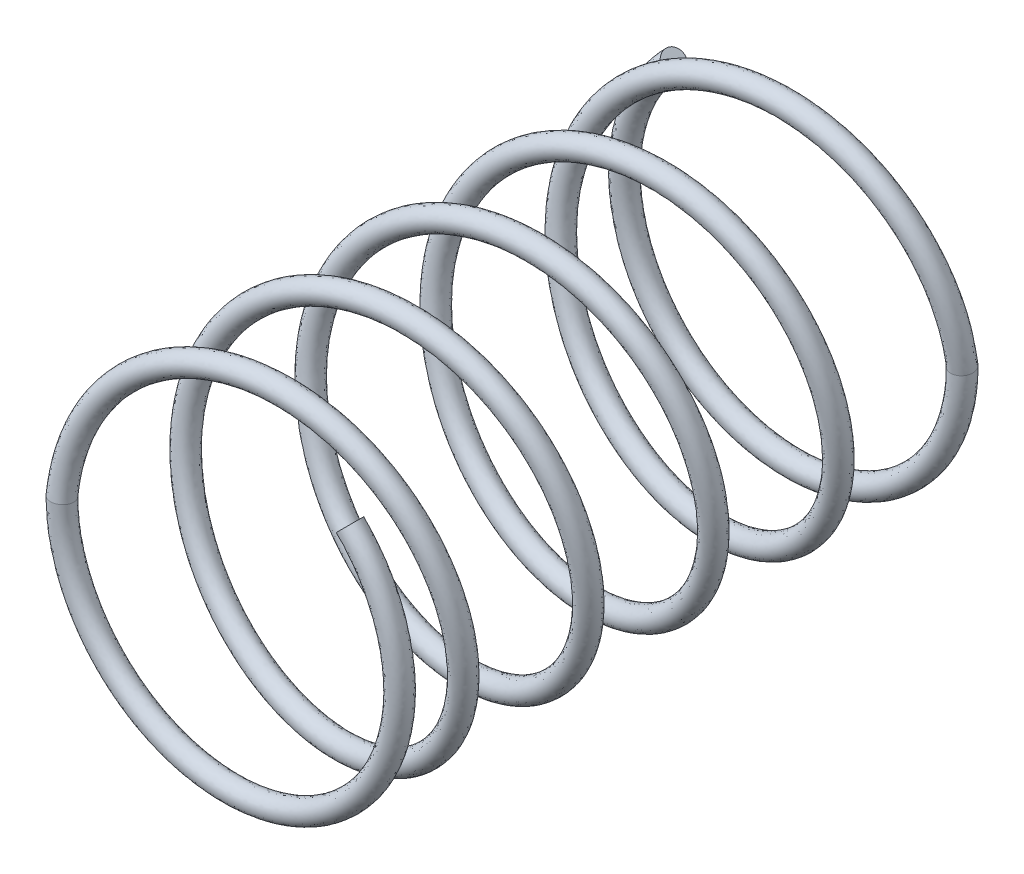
ISO-10303-21;
HEADER;
FILE_DESCRIPTION(('STEP AP214'),'2;1');
FILE_NAME('part.step','',(''),(''),'','','');
FILE_SCHEMA(('AUTOMOTIVE_DESIGN { 1 0 10303 214 1 1 1 1 }'));
ENDSEC;
DATA;
#1=APPLICATION_CONTEXT('core data for automotive mechanical design processes');
#2=APPLICATION_PROTOCOL_DEFINITION('international standard','automotive_design',2000,#1);
#3=PRODUCT_CONTEXT('',#1,'mechanical');
#4=PRODUCT('Part','Part','',(#3));
#5=PRODUCT_RELATED_PRODUCT_CATEGORY('part','',(#4));
#6=PRODUCT_DEFINITION_FORMATION('','',#4);
#7=PRODUCT_DEFINITION_CONTEXT('part definition',#1,'design');
#8=PRODUCT_DEFINITION('design','',#6,#7);
#9=PRODUCT_DEFINITION_SHAPE('','',#8);
#10=(LENGTH_UNIT() NAMED_UNIT(*) SI_UNIT(.MILLI.,.METRE.));
#11=(NAMED_UNIT(*) PLANE_ANGLE_UNIT() SI_UNIT($,.RADIAN.));
#12=(NAMED_UNIT(*) SI_UNIT($,.STERADIAN.) SOLID_ANGLE_UNIT());
#13=UNCERTAINTY_MEASURE_WITH_UNIT(LENGTH_MEASURE(1.E-05),#10,'distance_accuracy_value','');
#14=(GEOMETRIC_REPRESENTATION_CONTEXT(3) GLOBAL_UNCERTAINTY_ASSIGNED_CONTEXT((#13)) GLOBAL_UNIT_ASSIGNED_CONTEXT((#10,
#11,#12)) REPRESENTATION_CONTEXT('',''));
#15=CARTESIAN_POINT('',(0.,0.,0.));
#16=DIRECTION('',(0.,0.,1.));
#17=DIRECTION('',(1.,0.,0.));
#18=AXIS2_PLACEMENT_3D('',#15,#16,#17);
#19=CARTESIAN_POINT('',(2.26274169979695,2.26274169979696,0.));
#20=CARTESIAN_POINT('',(2.36527575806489,2.15125987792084,0.));
#21=CARTESIAN_POINT('',(2.6049419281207,1.89067893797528,0.));
#22=CARTESIAN_POINT('',(2.88182558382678,1.42821536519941,0.));
#23=CARTESIAN_POINT('',(3.07958803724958,0.919546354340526,0.));
#24=CARTESIAN_POINT('',(3.17979104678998,0.444635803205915,0.));
#25=CARTESIAN_POINT('',(3.20947367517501,9.56273396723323E-06,0.));
#26=CARTESIAN_POINT('',(3.1798251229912,-0.444676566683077,0.));
#27=CARTESIAN_POINT('',(3.07942217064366,-0.919374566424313,0.));
#28=CARTESIAN_POINT('',(2.88256882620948,-1.42897732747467,0.));
#29=CARTESIAN_POINT('',(2.58854346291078,-1.91008804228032,0.));
#30=CARTESIAN_POINT('',(2.2087330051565,-2.33734573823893,0.));
#31=CARTESIAN_POINT('',(1.76244094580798,-2.69238655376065,0.));
#32=CARTESIAN_POINT('',(1.23115106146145,-2.97499622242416,0.));
#33=CARTESIAN_POINT('',(0.633751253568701,-3.15788573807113,0.));
#34=CARTESIAN_POINT('',(-1.23007605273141E-07,-3.22126359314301,0.));
#35=CARTESIAN_POINT('',(-0.633750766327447,-3.15788573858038,0.));
#36=CARTESIAN_POINT('',(-1.23115270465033,-2.97499622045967,0.));
#37=CARTESIAN_POINT('',(-1.76243522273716,-2.69238656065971,0.));
#38=CARTESIAN_POINT('',(-2.20875256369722,-2.33734571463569,0.));
#39=CARTESIAN_POINT('',(-2.58847167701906,-1.91008812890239,0.));
#40=CARTESIAN_POINT('',(-2.88286607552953,-1.42897696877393,0.));
#41=CARTESIAN_POINT('',(-3.07849211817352,-0.919375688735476,0.));
#42=CARTESIAN_POINT('',(-3.18272624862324,-0.444672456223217,0.));
#43=CARTESIAN_POINT('',(-3.19448363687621,-0.142005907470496,0.));
#44=CARTESIAN_POINT('',(-3.2,0.,0.));
#45=CARTESIAN_POINT('',(2.26274169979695,2.26274169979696,0.4));
#46=CARTESIAN_POINT('',(2.36527575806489,2.15125987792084,0.4));
#47=CARTESIAN_POINT('',(2.6049419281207,1.89067893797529,0.4));
#48=CARTESIAN_POINT('',(2.88182558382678,1.42821536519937,0.4));
#49=CARTESIAN_POINT('',(3.07958803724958,0.919546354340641,0.4));
#50=CARTESIAN_POINT('',(3.17979104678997,0.444635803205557,0.4));
#51=CARTESIAN_POINT('',(3.20947367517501,9.56273513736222E-06,0.4));
#52=CARTESIAN_POINT('',(3.1798251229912,-0.444676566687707,0.4));
#53=CARTESIAN_POINT('',(3.07942217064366,-0.919374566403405,0.4));
#54=CARTESIAN_POINT('',(2.88256882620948,-1.42897732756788,0.4));
#55=CARTESIAN_POINT('',(2.58854346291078,-1.91008804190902,0.4));
#56=CARTESIAN_POINT('',(2.2087330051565,-2.33734573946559,0.4));
#57=CARTESIAN_POINT('',(1.76244094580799,-2.69238654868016,0.4));
#58=CARTESIAN_POINT('',(1.23115106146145,-2.97499624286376,0.4));
#59=CARTESIAN_POINT('',(0.633751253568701,-3.1578856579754,0.4));
#60=CARTESIAN_POINT('',(-1.23007605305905E-07,-3.22126389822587,0.4));
#61=CARTESIAN_POINT('',(-0.633750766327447,-3.15788461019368,0.4));
#62=CARTESIAN_POINT('',(-1.23115270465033,-2.9750002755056,0.4));
#63=CARTESIAN_POINT('',(-1.76243522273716,-2.69237237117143,0.4));
#64=CARTESIAN_POINT('',(-2.20875256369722,-2.33739422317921,0.4));
#65=CARTESIAN_POINT('',(-2.58847167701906,-1.90991008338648,0.4));
#66=CARTESIAN_POINT('',(-2.88286607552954,-1.42971421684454,0.4));
#67=CARTESIAN_POINT('',(-3.0784921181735,-0.917068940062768,0.4));
#68=CARTESIAN_POINT('',(-3.18272624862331,-0.451867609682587,0.4));
#69=CARTESIAN_POINT('',(-3.19448363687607,-0.128310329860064,0.4));
#70=CARTESIAN_POINT('',(-3.19999999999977,0.0234971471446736,0.4));
#71=CARTESIAN_POINT('',(1.97989898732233,1.97989898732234,0.4));
#72=CARTESIAN_POINT('',(2.06961628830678,1.88235239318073,0.4));
#73=CARTESIAN_POINT('',(2.27932418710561,1.65434407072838,0.4));
#74=CARTESIAN_POINT('',(2.52159738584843,1.24968844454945,0.4));
#75=CARTESIAN_POINT('',(2.69463953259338,0.804603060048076,0.4));
#76=CARTESIAN_POINT('',(2.78231716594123,0.389056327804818,0.4));
#77=CARTESIAN_POINT('',(2.80828946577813,8.36739339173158E-06,0.4));
#78=CARTESIAN_POINT('',(2.7823469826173,-0.389091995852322,0.4));
#79=CARTESIAN_POINT('',(2.6944943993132,-0.804452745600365,0.4));
#80=CARTESIAN_POINT('',(2.52224772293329,-1.25035516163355,0.4));
#81=CARTESIAN_POINT('',(2.26497553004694,-1.67132703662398,0.4));
#82=CARTESIAN_POINT('',(1.93264137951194,-2.04517752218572,0.4));
#83=CARTESIAN_POINT('',(1.54213582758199,-2.35583822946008,0.4));
#84=CARTESIAN_POINT('',(1.07725717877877,-2.60312171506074,0.4));
#85=CARTESIAN_POINT('',(0.554532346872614,-2.76314994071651,0.4));
#86=CARTESIAN_POINT('',(-1.07631654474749E-07,-2.81860594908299,0.4));
#87=CARTESIAN_POINT('',(-0.554531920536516,-2.76314889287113,0.4));
#88=CARTESIAN_POINT('',(-1.07725861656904,-2.60312574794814,0.4));
#89=CARTESIAN_POINT('',(-1.54213081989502,-2.35582405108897,0.4));
#90=CARTESIAN_POINT('',(-1.93265849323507,-2.04522600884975,0.4));
#91=CARTESIAN_POINT('',(-2.26491271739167,-1.67114906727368,0.4));
#92=CARTESIAN_POINT('',(-2.52250781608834,-1.2510920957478,0.4));
#93=CARTESIAN_POINT('',(-2.69368060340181,-0.802146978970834,0.4));
#94=CARTESIAN_POINT('',(-2.7848854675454,-0.396283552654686,0.4));
#95=CARTESIAN_POINT('',(-2.79517318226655,-0.110559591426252,0.4));
#96=CARTESIAN_POINT('',(-2.79999999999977,0.023497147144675,0.4));
#97=CARTESIAN_POINT('',(1.97989898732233,1.97989898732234,0.));
#98=CARTESIAN_POINT('',(2.06961628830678,1.88235239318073,0.));
#99=CARTESIAN_POINT('',(2.27932418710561,1.65434407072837,0.));
#100=CARTESIAN_POINT('',(2.52159738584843,1.24968844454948,0.));
#101=CARTESIAN_POINT('',(2.69463953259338,0.804603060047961,0.));
#102=CARTESIAN_POINT('',(2.78231716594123,0.389056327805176,0.));
#103=CARTESIAN_POINT('',(2.80828946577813,8.36739222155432E-06,0.));
#104=CARTESIAN_POINT('',(2.7823469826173,-0.389091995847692,0.));
#105=CARTESIAN_POINT('',(2.6944943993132,-0.804452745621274,0.));
#106=CARTESIAN_POINT('',(2.52224772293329,-1.25035516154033,0.));
#107=CARTESIAN_POINT('',(2.26497553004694,-1.67132703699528,0.));
#108=CARTESIAN_POINT('',(1.93264137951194,-2.04517752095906,0.));
#109=CARTESIAN_POINT('',(1.54213582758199,-2.35583823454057,0.));
#110=CARTESIAN_POINT('',(1.07725717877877,-2.60312169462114,0.));
#111=CARTESIAN_POINT('',(0.554532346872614,-2.76315002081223,0.));
#112=CARTESIAN_POINT('',(-1.0763165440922E-07,-2.81860564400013,0.));
#113=CARTESIAN_POINT('',(-0.554531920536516,-2.76315002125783,0.));
#114=CARTESIAN_POINT('',(-1.07725861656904,-2.60312169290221,0.));
#115=CARTESIAN_POINT('',(-1.54213081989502,-2.35583824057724,0.));
#116=CARTESIAN_POINT('',(-1.93265849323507,-2.04517750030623,0.));
#117=CARTESIAN_POINT('',(-2.26491271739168,-1.67132711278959,0.));
#118=CARTESIAN_POINT('',(-2.52250781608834,-1.25035484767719,0.));
#119=CARTESIAN_POINT('',(-2.69368060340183,-0.804453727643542,0.));
#120=CARTESIAN_POINT('',(-2.78488546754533,-0.389088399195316,0.));
#121=CARTESIAN_POINT('',(-2.79517318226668,-0.124255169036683,0.));
#122=CARTESIAN_POINT('',(-2.8,0.,0.));
#123=CARTESIAN_POINT('',(1.97989898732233,1.97989898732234,-0.4));
#124=CARTESIAN_POINT('',(2.06961628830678,1.88235239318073,-0.4));
#125=CARTESIAN_POINT('',(2.27932418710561,1.65434407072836,-0.4));
#126=CARTESIAN_POINT('',(2.52159738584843,1.24968844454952,-0.4));
#127=CARTESIAN_POINT('',(2.69463953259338,0.804603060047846,-0.4));
#128=CARTESIAN_POINT('',(2.78231716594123,0.389056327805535,-0.4));
#129=CARTESIAN_POINT('',(2.80828946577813,8.36739105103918E-06,-0.4));
#130=CARTESIAN_POINT('',(2.7823469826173,-0.389091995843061,-0.4));
#131=CARTESIAN_POINT('',(2.6944943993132,-0.804452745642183,-0.4));
#132=CARTESIAN_POINT('',(2.52224772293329,-1.25035516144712,-0.4));
#133=CARTESIAN_POINT('',(2.26497553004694,-1.67132703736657,-0.4));
#134=CARTESIAN_POINT('',(1.93264137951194,-2.0451775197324,-0.4));
#135=CARTESIAN_POINT('',(1.54213582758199,-2.35583823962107,-0.4));
#136=CARTESIAN_POINT('',(1.07725717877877,-2.60312167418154,-0.4));
#137=CARTESIAN_POINT('',(0.554532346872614,-2.76315010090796,-0.4));
#138=CARTESIAN_POINT('',(-1.07631654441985E-07,-2.81860533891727,-0.4));
#139=CARTESIAN_POINT('',(-0.554531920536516,-2.76315114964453,-0.4));
#140=CARTESIAN_POINT('',(-1.07725861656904,-2.60311763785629,-0.4));
#141=CARTESIAN_POINT('',(-1.54213081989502,-2.35585243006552,-0.4));
#142=CARTESIAN_POINT('',(-1.93265849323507,-2.04512899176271,-0.4));
#143=CARTESIAN_POINT('',(-2.26491271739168,-1.6715051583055,-0.4));
#144=CARTESIAN_POINT('',(-2.52250781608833,-1.24961759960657,-0.4));
#145=CARTESIAN_POINT('',(-2.69368060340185,-0.806760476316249,-0.4));
#146=CARTESIAN_POINT('',(-2.78488546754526,-0.381893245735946,-0.4));
#147=CARTESIAN_POINT('',(-2.79517318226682,-0.137950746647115,-0.4));
#148=CARTESIAN_POINT('',(-2.80000000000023,-0.0234971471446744,-0.4));
#149=CARTESIAN_POINT('',(2.26274169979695,2.26274169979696,-0.4));
#150=CARTESIAN_POINT('',(2.36527575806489,2.15125987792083,-0.4));
#151=CARTESIAN_POINT('',(2.6049419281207,1.89067893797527,-0.4));
#152=CARTESIAN_POINT('',(2.88182558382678,1.42821536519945,-0.4));
#153=CARTESIAN_POINT('',(3.07958803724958,0.919546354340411,-0.4));
#154=CARTESIAN_POINT('',(3.17979104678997,0.444635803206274,-0.4));
#155=CARTESIAN_POINT('',(3.20947367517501,9.562732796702E-06,-0.4));
#156=CARTESIAN_POINT('',(3.1798251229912,-0.444676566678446,-0.4));
#157=CARTESIAN_POINT('',(3.07942217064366,-0.919374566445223,-0.4));
#158=CARTESIAN_POINT('',(2.88256882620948,-1.42897732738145,-0.4));
#159=CARTESIAN_POINT('',(2.58854346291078,-1.91008804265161,-0.4));
#160=CARTESIAN_POINT('',(2.2087330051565,-2.33734573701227,-0.4));
#161=CARTESIAN_POINT('',(1.76244094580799,-2.69238655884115,-0.4));
#162=CARTESIAN_POINT('',(1.23115106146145,-2.97499620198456,-0.4));
#163=CARTESIAN_POINT('',(0.633751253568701,-3.15788581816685,-0.4));
#164=CARTESIAN_POINT('',(-1.23007605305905E-07,-3.22126328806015,-0.4));
#165=CARTESIAN_POINT('',(-0.633750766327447,-3.15788686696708,-0.4));
#166=CARTESIAN_POINT('',(-1.23115270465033,-2.97499216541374,-0.4));
#167=CARTESIAN_POINT('',(-1.76243522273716,-2.69240075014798,-0.4));
#168=CARTESIAN_POINT('',(-2.20875256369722,-2.33729720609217,-0.4));
#169=CARTESIAN_POINT('',(-2.58847167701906,-1.9102661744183,-0.4));
#170=CARTESIAN_POINT('',(-2.88286607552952,-1.42823972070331,-0.4));
#171=CARTESIAN_POINT('',(-3.07849211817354,-0.921682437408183,-0.4));
#172=CARTESIAN_POINT('',(-3.18272624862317,-0.437477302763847,-0.4));
#173=CARTESIAN_POINT('',(-3.19448363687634,-0.155701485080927,-0.4));
#174=CARTESIAN_POINT('',(-3.20000000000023,-0.0234971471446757,-0.4));
#175=CARTESIAN_POINT('',(2.26274169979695,2.26274169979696,0.));
#176=CARTESIAN_POINT('',(2.36527575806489,2.15125987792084,0.));
#177=CARTESIAN_POINT('',(2.6049419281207,1.89067893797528,0.));
#178=CARTESIAN_POINT('',(2.88182558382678,1.42821536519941,0.));
#179=CARTESIAN_POINT('',(3.07958803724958,0.919546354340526,0.));
#180=CARTESIAN_POINT('',(3.17979104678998,0.444635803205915,0.));
#181=CARTESIAN_POINT('',(3.20947367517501,9.56273396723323E-06,0.));
#182=CARTESIAN_POINT('',(3.1798251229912,-0.444676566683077,0.));
#183=CARTESIAN_POINT('',(3.07942217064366,-0.919374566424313,0.));
#184=CARTESIAN_POINT('',(2.88256882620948,-1.42897732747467,0.));
#185=CARTESIAN_POINT('',(2.58854346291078,-1.91008804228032,0.));
#186=CARTESIAN_POINT('',(2.2087330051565,-2.33734573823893,0.));
#187=CARTESIAN_POINT('',(1.76244094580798,-2.69238655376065,0.));
#188=CARTESIAN_POINT('',(1.23115106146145,-2.97499622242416,0.));
#189=CARTESIAN_POINT('',(0.633751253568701,-3.15788573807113,0.));
#190=CARTESIAN_POINT('',(-1.23007605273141E-07,-3.22126359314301,0.));
#191=CARTESIAN_POINT('',(-0.633750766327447,-3.15788573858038,0.));
#192=CARTESIAN_POINT('',(-1.23115270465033,-2.97499622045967,0.));
#193=CARTESIAN_POINT('',(-1.76243522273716,-2.69238656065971,0.));
#194=CARTESIAN_POINT('',(-2.20875256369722,-2.33734571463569,0.));
#195=CARTESIAN_POINT('',(-2.58847167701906,-1.91008812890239,0.));
#196=CARTESIAN_POINT('',(-2.88286607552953,-1.42897696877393,0.));
#197=CARTESIAN_POINT('',(-3.07849211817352,-0.919375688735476,0.));
#198=CARTESIAN_POINT('',(-3.18272624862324,-0.444672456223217,0.));
#199=CARTESIAN_POINT('',(-3.19448363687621,-0.142005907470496,0.));
#200=CARTESIAN_POINT('',(-3.2,0.,0.));
#201=(BOUNDED_SURFACE() B_SPLINE_SURFACE(3,3,((#19,#20,#21,#22,#23,#24,#25,#26,#27,#28,#29,#30,
#31,#32,#33,#34,#35,#36,#37,#38,#39,#40,#41,#42,#43,#44),(#45,#46,#47,#48,#49,#50,#51,#52,#53,
#54,#55,#56,#57,#58,#59,#60,#61,#62,#63,#64,#65,#66,#67,#68,#69,#70),(#71,#72,#73,#74,#75,#76,
#77,#78,#79,#80,#81,#82,#83,#84,#85,#86,#87,#88,#89,#90,#91,#92,#93,#94,#95,#96),(#97,#98,#99,
#100,#101,#102,#103,#104,#105,#106,#107,#108,#109,#110,#111,#112,#113,#114,#115,#116,#117,#118,
#119,#120,#121,#122),(#123,#124,#125,#126,#127,#128,#129,#130,#131,#132,#133,#134,#135,#136,
#137,#138,#139,#140,#141,#142,#143,#144,#145,#146,#147,#148),(#149,#150,#151,#152,#153,#154,
#155,#156,#157,#158,#159,#160,#161,#162,#163,#164,#165,#166,#167,#168,#169,#170,#171,#172,#173,
#174),(#175,#176,#177,#178,#179,#180,#181,#182,#183,#184,#185,#186,#187,#188,#189,#190,#191,
#192,#193,#194,#195,#196,#197,#198,#199,#200)),.UNSPECIFIED.,.T.,.F.,
.F.) B_SPLINE_SURFACE_WITH_KNOTS((4,3,4),(4,1,1,1,1,1,1,1,1,1,1,1,1,1,1,1,1,1,1,1,1,1,1,4),(0.,
0.5,1.),(0.,0.0361494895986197,0.0844968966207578,0.127740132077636,0.166117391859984,
0.200038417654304,0.233959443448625,0.272336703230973,0.315579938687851,0.363927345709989,
0.406275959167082,0.45162634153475,0.499521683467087,0.549277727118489,0.600019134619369,
0.650760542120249,0.70051658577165,0.748411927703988,0.793762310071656,0.83611092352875,
0.884458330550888,0.927701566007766,0.966078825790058,1.),
.UNSPECIFIED.) GEOMETRIC_REPRESENTATION_ITEM() RATIONAL_B_SPLINE_SURFACE(((1.,1.,1.,1.,1.,1.,1.,
1.,1.,1.,1.,1.,1.,1.,1.,1.,1.,1.,1.,1.,1.,1.,1.,1.,1.,1.),(0.333333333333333,0.333333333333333,
0.333333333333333,0.333333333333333,0.333333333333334,0.333333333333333,0.333333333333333,
0.333333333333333,0.333333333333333,0.333333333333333,0.333333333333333,0.333333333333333,
0.333333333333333,0.333333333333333,0.333333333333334,0.333333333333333,0.333333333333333,
0.333333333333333,0.333333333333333,0.333333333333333,0.333333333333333,0.333333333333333,
0.333333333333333,0.333333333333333,0.333333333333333,0.333333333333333),(0.333333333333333,
0.333333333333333,0.333333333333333,0.333333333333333,0.333333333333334,0.333333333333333,
0.333333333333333,0.333333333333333,0.333333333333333,0.333333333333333,0.333333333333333,
0.333333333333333,0.333333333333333,0.333333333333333,0.333333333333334,0.333333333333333,
0.333333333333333,0.333333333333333,0.333333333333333,0.333333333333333,0.333333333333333,
0.333333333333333,0.333333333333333,0.333333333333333,0.333333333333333,0.333333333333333),(1.,
1.,1.,1.,1.,1.,1.,1.,1.,1.,1.,1.,1.,1.,1.,1.,1.,1.,1.,1.,1.,1.,1.,1.,1.,1.),(0.333333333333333,
0.333333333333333,0.333333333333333,0.333333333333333,0.333333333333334,0.333333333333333,
0.333333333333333,0.333333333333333,0.333333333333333,0.333333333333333,0.333333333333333,
0.333333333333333,0.333333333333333,0.333333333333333,0.333333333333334,0.333333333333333,
0.333333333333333,0.333333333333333,0.333333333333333,0.333333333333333,0.333333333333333,
0.333333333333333,0.333333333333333,0.333333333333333,0.333333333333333,0.333333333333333),
(0.333333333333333,0.333333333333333,0.333333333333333,0.333333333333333,0.333333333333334,
0.333333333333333,0.333333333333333,0.333333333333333,0.333333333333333,0.333333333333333,
0.333333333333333,0.333333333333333,0.333333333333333,0.333333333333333,0.333333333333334,
0.333333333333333,0.333333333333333,0.333333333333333,0.333333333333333,0.333333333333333,
0.333333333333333,0.333333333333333,0.333333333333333,0.333333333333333,0.333333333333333,
0.333333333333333),(1.,1.,1.,1.,1.,1.,1.,1.,1.,1.,1.,1.,1.,1.,1.,1.,1.,1.,1.,1.,1.,1.,1.,1.,1.,1.))) REPRESENTATION_ITEM('') SURFACE());
#202=CARTESIAN_POINT('',(2.12132034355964,2.12132034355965,0.));
#203=DIRECTION('',(0.707106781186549,-0.707106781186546,0.));
#204=DIRECTION('',(0.707106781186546,0.707106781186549,0.));
#205=AXIS2_PLACEMENT_3D('',#202,#203,#204);
#206=CIRCLE('',#205,0.2);
#207=CARTESIAN_POINT('',(2.26274169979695,2.26274169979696,0.));
#208=VERTEX_POINT('',#207);
#209=EDGE_CURVE('E11',#208,#208,#206,.T.);
#210=CARTESIAN_POINT('',(-3.2,0.,0.));
#211=CARTESIAN_POINT('',(-3.20000000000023,-0.0234971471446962,-0.399999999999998));
#212=CARTESIAN_POINT('',(-2.80000000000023,-0.0234971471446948,-0.399999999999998));
#213=CARTESIAN_POINT('',(-2.8,0.,0.));
#214=CARTESIAN_POINT('',(-2.79999999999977,0.0234971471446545,0.400000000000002));
#215=CARTESIAN_POINT('',(-3.19999999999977,0.0234971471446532,0.400000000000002));
#216=CARTESIAN_POINT('',(-3.2,0.,0.));
#217=(BOUNDED_CURVE() B_SPLINE_CURVE(3,(#210,#211,#212,#213,#214,#215,#216),.UNSPECIFIED.,.T.,
.F.) B_SPLINE_CURVE_WITH_KNOTS((4,3,4),(0.,0.5,1.),
.UNSPECIFIED.) CURVE() GEOMETRIC_REPRESENTATION_ITEM() RATIONAL_B_SPLINE_CURVE((1.,
0.333333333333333,0.333333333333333,1.,0.333333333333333,0.333333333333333,1.)) REPRESENTATION_ITEM(''));
#218=CARTESIAN_POINT('',(-3.2,0.,0.));
#219=VERTEX_POINT('',#218);
#220=EDGE_CURVE('E48',#219,#219,#217,.T.);
#221=ORIENTED_EDGE('',*,*,#209,.T.);
#222=EDGE_LOOP('',(#221));
#223=FACE_BOUND('',#222,.T.);
#224=ORIENTED_EDGE('',*,*,#220,.T.);
#225=EDGE_LOOP('',(#224));
#226=FACE_BOUND('',#225,.T.);
#227=ADVANCED_FACE('F36',(#223,#226),#201,.T.);
#228=CARTESIAN_POINT('',(2.12132034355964,2.12132034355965,0.));
#229=DIRECTION('',(0.707106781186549,-0.707106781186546,0.));
#230=DIRECTION('',(0.707106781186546,0.707106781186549,0.));
#231=AXIS2_PLACEMENT_3D('',#228,#229,#230);
#232=PLANE('',#231);
#233=ORIENTED_EDGE('',*,*,#209,.F.);
#234=EDGE_LOOP('',(#233));
#235=FACE_BOUND('',#234,.T.);
#236=ADVANCED_FACE('F79',(#235),#232,.F.);
#237=CARTESIAN_POINT('',(-3.2,0.,0.));
#238=CARTESIAN_POINT('',(-3.2,0.220103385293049,-0.0259485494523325));
#239=CARTESIAN_POINT('',(-3.14705357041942,0.71338031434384,-0.0780476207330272));
#240=CARTESIAN_POINT('',(-2.91677819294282,1.37735956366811,-0.156370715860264));
#241=CARTESIAN_POINT('',(-2.54327277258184,1.98533691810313,-0.234359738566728));
#242=CARTESIAN_POINT('',(-2.04626881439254,2.4936574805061,-0.312579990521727));
#243=CARTESIAN_POINT('',(-1.45073515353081,2.88153967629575,-0.390558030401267));
#244=CARTESIAN_POINT('',(-0.783688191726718,3.1292477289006,-0.46886506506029));
#245=CARTESIAN_POINT('',(-0.0792656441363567,3.22527965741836,-0.546848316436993));
#246=CARTESIAN_POINT('',(0.629311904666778,3.16379760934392,-0.625022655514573));
#247=CARTESIAN_POINT('',(1.30750026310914,2.9494394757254,-0.703201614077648));
#248=CARTESIAN_POINT('',(1.92152101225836,2.59111847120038,-0.78120970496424));
#249=CARTESIAN_POINT('',(2.44297219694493,2.10705663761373,-0.859495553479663));
#250=CARTESIAN_POINT('',(2.84499367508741,1.52092416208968,-0.937428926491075));
#251=CARTESIAN_POINT('',(3.10912278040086,0.860215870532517,-1.01574167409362));
#252=CARTESIAN_POINT('',(3.22230205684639,0.158472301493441,-1.09370059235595));
#253=CARTESIAN_POINT('',(3.17830048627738,-0.551563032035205,-1.17193882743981));
#254=CARTESIAN_POINT('',(2.98069491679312,-1.23464076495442,-1.25002729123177));
#255=CARTESIAN_POINT('',(2.63741550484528,-1.85737856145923,-1.32811563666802));
#256=CARTESIAN_POINT('',(2.16645962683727,-2.39056409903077,-1.40635381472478));
#257=CARTESIAN_POINT('',(1.59022291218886,-2.8067430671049,-1.48431310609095));
#258=CARTESIAN_POINT('',(0.936264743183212,-3.087168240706,-1.56262567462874));
#259=CARTESIAN_POINT('',(0.237534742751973,-3.21735639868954,-1.64055774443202));
#260=CARTESIAN_POINT('',(-0.473471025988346,-3.19091777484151,-1.71884526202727));
#261=CARTESIAN_POINT('',(-1.16101792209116,-3.01011094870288,-1.79685736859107));
#262=CARTESIAN_POINT('',(-1.79214932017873,-2.68214682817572,-1.87502725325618));
#263=CARTESIAN_POINT('',(-2.33667309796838,-2.2245649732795,-1.95319713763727));
#264=CARTESIAN_POINT('',(-2.76683078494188,-1.65854711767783,-2.03120924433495));
#265=CARTESIAN_POINT('',(-3.06334828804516,-1.01178165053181,-2.10949676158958));
#266=CARTESIAN_POINT('',(-3.21046393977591,-0.316418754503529,-2.18742883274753));
#267=CARTESIAN_POINT('',(-3.20164521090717,0.395073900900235,-2.26574140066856));
#268=CARTESIAN_POINT('',(-3.03766364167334,1.08671233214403,-2.34370068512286));
#269=CARTESIAN_POINT('',(-2.72529272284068,1.72586072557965,-2.42193887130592));
#270=CARTESIAN_POINT('',(-2.28132647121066,2.28132188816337,-2.50002725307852));
#271=CARTESIAN_POINT('',(-1.72586620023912,2.72528926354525,-2.57811563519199));
#272=CARTESIAN_POINT('',(-1.08671842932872,3.03766144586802,-2.6563538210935));
#273=CARTESIAN_POINT('',(-0.395080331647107,3.20164443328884,-2.73431310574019));
#274=CARTESIAN_POINT('',(0.316412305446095,3.21046455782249,-2.81262567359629));
#275=CARTESIAN_POINT('',(1.01177550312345,3.0633503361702,-2.89055774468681));
#276=CARTESIAN_POINT('',(1.65854155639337,2.76683410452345,-2.96884526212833));
#277=CARTESIAN_POINT('',(2.22456028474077,2.33667757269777,-3.04685736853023));
#278=CARTESIAN_POINT('',(2.68214323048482,1.79215470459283,-3.12502725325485));
#279=CARTESIAN_POINT('',(3.01010860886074,1.16102396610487,-3.20319713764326));
#280=CARTESIAN_POINT('',(3.19091683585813,0.473477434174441,-3.28120924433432));
#281=CARTESIAN_POINT('',(3.21735685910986,-0.237528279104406,-3.35949676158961));
#282=CARTESIAN_POINT('',(3.08717013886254,-0.936258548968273,-3.43742883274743));
#283=CARTESIAN_POINT('',(2.80674624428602,-1.59021726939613,-3.51574140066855));
#284=CARTESIAN_POINT('',(2.39056845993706,-2.16645483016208,-3.5937006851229));
#285=CARTESIAN_POINT('',(1.85738386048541,-2.63741177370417,-3.67193887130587));
#286=CARTESIAN_POINT('',(1.23464674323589,-2.98069244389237,-3.75002725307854));
#287=CARTESIAN_POINT('',(0.551569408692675,-3.17829937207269,-3.828115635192));
#288=CARTESIAN_POINT('',(-0.15846579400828,-3.22230237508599,-3.90635382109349));
#289=CARTESIAN_POINT('',(-0.86020964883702,-3.10912445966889,-3.98431310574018));
#290=CARTESIAN_POINT('',(-1.52091844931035,-2.84499674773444,-4.0626256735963));
#291=CARTESIAN_POINT('',(-2.10705210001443,-2.44297695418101,-4.1405577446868));
#292=CARTESIAN_POINT('',(-2.59111416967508,-1.92152502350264,-4.21884526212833));
#293=CARTESIAN_POINT('',(-2.94943350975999,-1.30750621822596,-4.29685736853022));
#294=CARTESIAN_POINT('',(-3.16380514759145,-0.629323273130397,-4.37502725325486));
#295=CARTESIAN_POINT('',(-3.2252823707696,0.079272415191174,-4.45319713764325));
#296=CARTESIAN_POINT('',(-3.12921472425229,0.783674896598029,-4.53120924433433));
#297=CARTESIAN_POINT('',(-2.88155201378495,1.45067668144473,-4.6094967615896));
#298=CARTESIAN_POINT('',(-2.49388266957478,2.04639897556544,-4.68742883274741));
#299=CARTESIAN_POINT('',(-1.98454560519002,2.54326447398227,-4.76574140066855));
#300=CARTESIAN_POINT('',(-1.37953090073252,2.91637421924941,-4.84370068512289));
#301=CARTESIAN_POINT('',(-0.706705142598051,3.14744078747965,-4.92193887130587));
#302=CARTESIAN_POINT('',(-3.24070392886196E-06,3.2262795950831,-5.00002725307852));
#303=CARTESIAN_POINT('',(0.706698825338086,3.14744221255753,-5.078115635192));
#304=CARTESIAN_POINT('',(1.37952503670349,2.9163769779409,-5.15635382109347));
#305=CARTESIAN_POINT('',(1.98454050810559,2.54326847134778,-5.23431310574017));
#306=CARTESIAN_POINT('',(2.49387854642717,2.04640397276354,-5.31262567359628));
#307=CARTESIAN_POINT('',(2.88154911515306,1.450682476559,-5.39055774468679));
#308=CARTESIAN_POINT('',(3.12921313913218,0.783681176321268,-5.46884526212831));
#309=CARTESIAN_POINT('',(3.22528221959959,0.0792788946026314,-5.54685736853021));
#310=CARTESIAN_POINT('',(3.16380641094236,-0.629316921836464,-5.62502725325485));
#311=CARTESIAN_POINT('',(2.94943612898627,-1.30750028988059,-5.70319713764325));
#312=CARTESIAN_POINT('',(2.59111803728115,-1.92151982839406,-5.78120924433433));
#313=CARTESIAN_POINT('',(2.10705699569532,-2.44297270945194,-5.8594967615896));
#314=CARTESIAN_POINT('',(1.52092417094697,-2.84499370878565,-5.93742883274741));
#315=CARTESIAN_POINT('',(0.860215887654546,-3.10912271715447,-6.01574140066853));
#316=CARTESIAN_POINT('',(0.158472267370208,-3.22230207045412,-6.09370068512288));
#317=CARTESIAN_POINT('',(-0.551563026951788,-3.17830047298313,-6.17193887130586));
#318=CARTESIAN_POINT('',(-1.23464075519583,-2.98069492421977,-6.25002725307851));
#319=CARTESIAN_POINT('',(-1.8573785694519,-2.63741550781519,-6.32811563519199));
#320=CARTESIAN_POINT('',(-2.39056409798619,-2.16645962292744,-6.40635382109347));
#321=CARTESIAN_POINT('',(-2.80674306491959,-1.59022291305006,-6.48431310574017));
#322=CARTESIAN_POINT('',(-3.08716824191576,-0.936264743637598,-6.56262567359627));
#323=CARTESIAN_POINT('',(-3.2173563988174,-0.237534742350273,-6.64055774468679));
#324=CARTESIAN_POINT('',(-3.19091777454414,0.473471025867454,-6.71884526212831));
#325=CARTESIAN_POINT('',(-3.01011094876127,1.16101792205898,-6.79685736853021));
#326=CARTESIAN_POINT('',(-2.68214682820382,1.79214932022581,-6.87502725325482));
#327=CARTESIAN_POINT('',(-2.22456497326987,2.33667309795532,-6.95319713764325));
#328=CARTESIAN_POINT('',(-1.65854711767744,2.76683078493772,-7.03120924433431));
#329=CARTESIAN_POINT('',(-1.01178165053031,3.06334828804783,-7.10949676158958));
#330=CARTESIAN_POINT('',(-0.316418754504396,3.21046393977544,-7.18742883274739));
#331=CARTESIAN_POINT('',(0.395073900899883,3.20164521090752,-7.26574140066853));
#332=CARTESIAN_POINT('',(1.08671233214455,3.03766364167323,-7.34370068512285));
#333=CARTESIAN_POINT('',(1.7258607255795,2.72529272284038,-7.42193887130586));
#334=CARTESIAN_POINT('',(2.2813218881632,2.2813264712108,-7.50002725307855));
#335=CARTESIAN_POINT('',(2.72528926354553,1.72586620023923,-7.57811563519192));
#336=CARTESIAN_POINT('',(3.03766144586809,1.08671842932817,-7.6563538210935));
#337=CARTESIAN_POINT('',(3.20164443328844,0.395080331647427,-7.73431310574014));
#338=CARTESIAN_POINT('',(3.21046455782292,-0.316412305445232,-7.81262567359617));
#339=CARTESIAN_POINT('',(3.06335033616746,-1.01177550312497,-7.89055774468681));
#340=CARTESIAN_POINT('',(2.76683410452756,-1.65854155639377,-7.96884526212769));
#341=CARTESIAN_POINT('',(2.33667757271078,-2.22456028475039,-8.0468573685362));
#342=CARTESIAN_POINT('',(1.7921547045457,-2.6821432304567,-8.12502725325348));
#343=CARTESIAN_POINT('',(1.16102396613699,-3.01010860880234,-8.20319713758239));
#344=CARTESIAN_POINT('',(0.47347743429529,-3.19091683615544,-8.28120924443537));
#345=CARTESIAN_POINT('',(-0.237528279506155,-3.21735685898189,-8.35949676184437));
#346=CARTESIAN_POINT('',(-0.936258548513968,-3.08717013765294,-8.43742883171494));
#347=CARTESIAN_POINT('',(-1.590217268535,-2.80674624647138,-8.51574140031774));
#348=CARTESIAN_POINT('',(-2.16645483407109,-2.39056846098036,-8.59370069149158));
#349=CARTESIAN_POINT('',(-2.63741177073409,-1.8573838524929,-8.67193886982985));
#350=CARTESIAN_POINT('',(-2.98069243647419,-1.23464675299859,-8.7500272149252));
#351=CARTESIAN_POINT('',(-3.17829938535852,-0.551569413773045,-8.82811567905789));
#352=CARTESIAN_POINT('',(-3.22230236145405,0.158465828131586,-8.90635391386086));
#353=CARTESIAN_POINT('',(-3.10912452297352,0.860209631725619,-8.9843128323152));
#354=CARTESIAN_POINT('',(-2.8449967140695,1.52091844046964,-9.06262557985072));
#355=CARTESIAN_POINT('',(-2.4429764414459,2.10705174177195,-9.14055895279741));
#356=CARTESIAN_POINT('',(-1.92152620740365,2.59111460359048,-9.21884480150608));
#357=CARTESIAN_POINT('',(-1.30750619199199,2.94943685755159,-9.2968528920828));
#358=CARTESIAN_POINT('',(-0.629318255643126,3.16379634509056,-9.3750318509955));
#359=CARTESIAN_POINT('',(0.0792591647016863,3.22527980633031,-9.45320618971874));
#360=CARTESIAN_POINT('',(0.783681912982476,3.12924931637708,-9.53118944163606));
#361=CARTESIAN_POINT('',(1.45072935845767,2.88154258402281,-9.60949647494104));
#362=CARTESIAN_POINT('',(2.04626381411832,2.49366156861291,-9.68747451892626));
#363=CARTESIAN_POINT('',(2.54326876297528,1.98534211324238,-9.76569475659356));
#364=CARTESIAN_POINT('',(2.91677550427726,1.37736507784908,-9.84368383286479));
#365=CARTESIAN_POINT('',(3.14705198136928,0.713387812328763,-9.92200674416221));
#366=CARTESIAN_POINT('',(3.19999999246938,0.220106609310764,-9.97410633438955));
#367=CARTESIAN_POINT('',(3.19999999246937,3.22403398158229E-06,-10.00005488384));
#368=CARTESIAN_POINT('',(-3.20000000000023,-0.0234971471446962,-0.399999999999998));
#369=CARTESIAN_POINT('',(-3.20000000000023,0.153222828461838,-0.420833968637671));
#370=CARTESIAN_POINT('',(-3.15908381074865,0.676688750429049,-0.476397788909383));
#371=CARTESIAN_POINT('',(-2.93629108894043,1.33204106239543,-0.55332244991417));
#372=CARTESIAN_POINT('',(-2.57245979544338,1.94880745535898,-0.631689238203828));
#373=CARTESIAN_POINT('',(-2.08267428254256,2.46345343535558,-0.709807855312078));
#374=CARTESIAN_POINT('',(-1.49294671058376,2.86039634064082,-0.787811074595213));
#375=CARTESIAN_POINT('',(-0.829433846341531,3.11759823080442,-0.866113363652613));
#376=CARTESIAN_POINT('',(-0.126488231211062,3.22414609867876,-0.94409643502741));
#377=CARTESIAN_POINT('',(0.583015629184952,3.17295524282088,-1.02227253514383));
#378=CARTESIAN_POINT('',(1.26426642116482,2.96847138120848,-1.10044896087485));
#379=CARTESIAN_POINT('',(1.88362593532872,2.61926101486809,-1.17845947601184));
#380=CARTESIAN_POINT('',(2.41199546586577,2.14270238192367,-1.25674374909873));
#381=CARTESIAN_POINT('',(2.82279648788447,1.56259792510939,-1.33467768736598));
#382=CARTESIAN_POINT('',(3.09636940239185,0.90566993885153,-1.41299092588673));
#383=CARTESIAN_POINT('',(3.2200267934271,0.205648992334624,-1.49094834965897));
#384=CARTESIAN_POINT('',(3.1862693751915,-0.505043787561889,-1.56918882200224));
#385=CARTESIAN_POINT('',(2.99872110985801,-1.19097693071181,-1.64727455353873));
#386=CARTESIAN_POINT('',(2.66458426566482,-1.81878597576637,-1.72536565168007));
#387=CARTESIAN_POINT('',(2.20135334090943,-2.35873206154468,-1.80360152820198));
#388=CARTESIAN_POINT('',(1.63132688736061,-2.78352360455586,-1.88156240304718));
#389=CARTESIAN_POINT('',(0.981396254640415,-3.07329001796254,-1.95987439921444));
#390=CARTESIAN_POINT('',(0.284635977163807,-3.21394658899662,-2.03780598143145));
#391=CARTESIAN_POINT('',(-0.42675914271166,-3.19770413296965,-2.11609495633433));
#392=CARTESIAN_POINT('',(-1.11694731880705,-3.02711320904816,-2.19410477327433));
#393=CARTESIAN_POINT('',(-1.75287772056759,-2.70832071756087,-2.27227735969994));
#394=CARTESIAN_POINT('',(-2.30401978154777,-2.25869816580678,-2.35044451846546));
#395=CARTESIAN_POINT('',(-2.74259026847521,-1.69904926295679,-2.42845897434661));
#396=CARTESIAN_POINT('',(-3.0483685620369,-1.0565678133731,-2.50674494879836));
#397=CARTESIAN_POINT('',(-3.20590454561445,-0.363414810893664,-2.58467760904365));
#398=CARTESIAN_POINT('',(-3.20725756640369,0.348199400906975,-2.66299065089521));
#399=CARTESIAN_POINT('',(-3.05361514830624,1.04225597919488,-2.74094843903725));
#400=CARTESIAN_POINT('',(-2.75045711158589,1.68593206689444,-2.81918886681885));
#401=CARTESIAN_POINT('',(-2.31468997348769,2.24788014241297,-2.89727451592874));
#402=CARTESIAN_POINT('',(-1.76573560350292,2.70003139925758,-2.97536564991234));
#403=CARTESIAN_POINT('',(-1.13113760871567,3.02160571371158,-3.05360153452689));
#404=CARTESIAN_POINT('',(-0.441941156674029,3.19592225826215,-3.13156240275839));
#405=CARTESIAN_POINT('',(0.269405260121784,3.21491383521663,-3.20987439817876));
#406=CARTESIAN_POINT('',(0.966954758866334,3.07822494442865,-3.28780598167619));
#407=CARTESIAN_POINT('',(1.61798243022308,2.79097974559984,-3.36609495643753));
#408=CARTESIAN_POINT('',(2.19035083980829,2.36925070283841,-3.44410477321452));
#409=CARTESIAN_POINT('',(2.65587731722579,1.83136481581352,-3.5222773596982));
#410=CARTESIAN_POINT('',(2.99300308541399,1.20505480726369,-3.60044451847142));
#411=CARTESIAN_POINT('',(3.18402101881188,0.520172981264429,-3.67845897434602));
#412=CARTESIAN_POINT('',(3.22065631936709,-0.190418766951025,-3.75674494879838));
#413=CARTESIAN_POINT('',(3.10094242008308,-0.891095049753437,-3.83467760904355));
#414=CARTESIAN_POINT('',(2.8298694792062,-1.54905863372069,-3.9129906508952));
#415=CARTESIAN_POINT('',(2.42231844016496,-2.13148689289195,-3.99094843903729));
#416=CARTESIAN_POINT('',(1.89591276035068,-2.61015249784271,-4.0691888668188));
#417=CARTESIAN_POINT('',(1.27826820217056,-2.96256395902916,-4.14727451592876));
#418=CARTESIAN_POINT('',(0.598069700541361,-3.1702215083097,-4.22536564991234));
#419=CARTESIAN_POINT('',(-0.111283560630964,-3.22446729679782,-4.30360153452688));
#420=CARTESIAN_POINT('',(-0.814726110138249,-3.12177072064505,-4.38156240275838));
#421=CARTESIAN_POINT('',(-1.47919226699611,-2.86709616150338,-4.45987439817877));
#422=CARTESIAN_POINT('',(-2.07133539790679,-2.47387145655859,-4.53780598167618));
#423=CARTESIAN_POINT('',(-2.56288255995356,-1.95935399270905,-4.61609495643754));
#424=CARTESIAN_POINT('',(-2.93029330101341,-1.3506912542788,-4.6941047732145));
#425=CARTESIAN_POINT('',(-3.15454366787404,-0.675600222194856,-4.77227735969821));
#426=CARTESIAN_POINT('',(-3.22632880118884,0.0320472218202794,-4.85044451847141));
#427=CARTESIAN_POINT('',(-3.14071343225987,0.73789492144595,-4.92845897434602));
#428=CARTESIAN_POINT('',(-2.90262834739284,1.40841581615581,-5.00674494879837));
#429=CARTESIAN_POINT('',(-2.5238899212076,2.00994376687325,-5.08467760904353));
#430=CARTESIAN_POINT('',(-2.02165941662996,2.51408773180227,-5.1629906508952));
#431=CARTESIAN_POINT('',(-1.42224570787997,2.89621824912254,-5.24094843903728));
#432=CARTESIAN_POINT('',(-0.752732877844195,3.13700087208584,-5.3191888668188));
#433=CARTESIAN_POINT('',(-0.0472416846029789,3.22622426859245,-5.39727451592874));
#434=CARTESIAN_POINT('',(0.660646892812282,3.1577741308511,-5.47536564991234));
#435=CARTESIAN_POINT('',(1.3367628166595,2.93643296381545,-5.55360153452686));
#436=CARTESIAN_POINT('',(1.94735871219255,2.57235788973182,-5.63156240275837));
#437=CARTESIAN_POINT('',(2.46378566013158,2.08278908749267,-5.70987439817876));
#438=CARTESIAN_POINT('',(2.86037399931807,1.49289346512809,-5.78780598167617));
#439=CARTESIAN_POINT('',(3.11760705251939,0.829434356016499,-5.86609495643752));
#440=CARTESIAN_POINT('',(3.22412517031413,0.126501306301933,-5.9441047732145));
#441=CARTESIAN_POINT('',(3.17295934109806,-0.583018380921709,-6.0222773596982));
#442=CARTESIAN_POINT('',(2.96847520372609,-1.2642703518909,-6.10044451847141));
#443=CARTESIAN_POINT('',(2.61926069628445,-1.88362501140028,-6.17845897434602));
#444=CARTESIAN_POINT('',(2.1427015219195,-2.41199432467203,-6.25674494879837));
#445=CARTESIAN_POINT('',(1.56259806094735,-2.82279676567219,-6.33467760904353));
#446=CARTESIAN_POINT('',(0.905670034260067,-3.09636976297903,-6.41299065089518));
#447=CARTESIAN_POINT('',(0.205648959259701,-3.22002663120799,-6.49094843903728));
#448=CARTESIAN_POINT('',(-0.505043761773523,-3.18626930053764,-6.56918886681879));
#449=CARTESIAN_POINT('',(-1.19097695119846,-2.99872117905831,-6.64727451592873));
#450=CARTESIAN_POINT('',(-1.81878598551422,-2.66458426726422,-6.72536564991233));
#451=CARTESIAN_POINT('',(-2.35873205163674,-2.20135333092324,-6.80360153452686));
#452=CARTESIAN_POINT('',(-2.78352360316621,-1.63132688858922,-6.88156240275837));
#453=CARTESIAN_POINT('',(-3.07329002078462,-0.981396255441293,-6.95987439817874));
#454=CARTESIAN_POINT('',(-3.21394658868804,-0.284635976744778,-7.03780598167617));
#455=CARTESIAN_POINT('',(-3.19770413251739,0.426759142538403,-7.11609495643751));
#456=CARTESIAN_POINT('',(-3.02711320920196,1.11694731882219,-7.19410477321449));
#457=CARTESIAN_POINT('',(-2.70832071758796,1.75287772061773,-7.27227735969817));
#458=CARTESIAN_POINT('',(-2.25869816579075,2.30401978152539,-7.35044451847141));
#459=CARTESIAN_POINT('',(-1.69904926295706,2.74259026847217,-7.42845897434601));
#460=CARTESIAN_POINT('',(-1.05656781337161,3.04836856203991,-7.50674494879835));
#461=CARTESIAN_POINT('',(-0.363414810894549,3.20590454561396,-7.58467760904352));
#462=CARTESIAN_POINT('',(0.348199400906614,3.20725756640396,-7.66299065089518));
#463=CARTESIAN_POINT('',(1.04225597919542,3.0536151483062,-7.74094843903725));
#464=CARTESIAN_POINT('',(1.68593206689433,2.75045711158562,-7.81918886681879));
#465=CARTESIAN_POINT('',(2.24788014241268,2.31468997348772,-7.89727451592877));
#466=CARTESIAN_POINT('',(2.70003139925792,1.76573560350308,-7.97536564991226));
#467=CARTESIAN_POINT('',(3.02160571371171,1.13113760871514,-8.05360153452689));
#468=CARTESIAN_POINT('',(3.1959222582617,0.441941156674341,-8.13156240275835));
#469=CARTESIAN_POINT('',(3.214913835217,-0.269405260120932,-8.20987439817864));
#470=CARTESIAN_POINT('',(3.07822494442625,-0.966954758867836,-8.2878059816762));
#471=CARTESIAN_POINT('',(2.79097974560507,-1.61798243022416,-8.36609495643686));
#472=CARTESIAN_POINT('',(2.3692507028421,-2.19035083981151,-8.4441047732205));
#473=CARTESIAN_POINT('',(1.83136481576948,-2.65587731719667,-8.52227735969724));
#474=CARTESIAN_POINT('',(1.20505480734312,-2.99300308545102,-8.60044451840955));
#475=CARTESIAN_POINT('',(0.520172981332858,-3.1840210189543,-8.6784589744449));
#476=CARTESIAN_POINT('',(-0.190418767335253,-3.22065631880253,-8.75674494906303));
#477=CARTESIAN_POINT('',(-0.891095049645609,-3.10094242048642,-8.83467760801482));
#478=CARTESIAN_POINT('',(-1.54905863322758,-2.82986948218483,-8.91299065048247));
#479=CARTESIAN_POINT('',(-2.13148689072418,-2.42231843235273,-8.99094844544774));
#480=CARTESIAN_POINT('',(-2.61015249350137,-1.89591275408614,-9.06918886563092));
#481=CARTESIAN_POINT('',(-2.9625640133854,-1.27826824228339,-9.14727447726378));
#482=CARTESIAN_POINT('',(-3.17022146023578,-0.598069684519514,-9.22536569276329));
#483=CARTESIAN_POINT('',(-3.22446710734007,0.111283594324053,-9.30360163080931));
#484=CARTESIAN_POINT('',(-3.12177120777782,0.814726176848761,-9.38156213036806));
#485=CARTESIAN_POINT('',(-2.86709637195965,1.47919236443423,-9.45987429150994));
#486=CARTESIAN_POINT('',(-2.47386929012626,2.0713338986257,-9.53780718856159));
#487=CARTESIAN_POINT('',(-1.95935543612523,2.56288282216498,-9.61609457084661));
#488=CARTESIAN_POINT('',(-1.35069513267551,2.93030488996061,-9.69410013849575));
#489=CARTESIAN_POINT('',(-0.675592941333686,3.1545261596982,-9.77228220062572));
#490=CARTESIAN_POINT('',(0.0320338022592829,3.22631768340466,-9.85045251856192));
#491=CARTESIAN_POINT('',(0.737909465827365,3.14073568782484,-9.92844435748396));
#492=CARTESIAN_POINT('',(1.4084679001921,2.90279519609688,-10.0067249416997));
#493=CARTESIAN_POINT('',(2.00978826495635,2.52300362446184,-10.0847939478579));
#494=CARTESIAN_POINT('',(2.51399445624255,2.02470010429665,-10.1626827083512));
#495=CARTESIAN_POINT('',(2.89716257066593,1.41181306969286,-10.2419117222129));
#496=CARTESIAN_POINT('',(3.13491376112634,0.79046516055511,-10.3155923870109));
#497=CARTESIAN_POINT('',(3.19989022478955,0.200217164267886,-10.3792212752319));
#498=CARTESIAN_POINT('',(3.19989022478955,0.0235003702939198,-10.4000548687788));
#499=CARTESIAN_POINT('',(-2.80000000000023,-0.0234971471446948,-0.399999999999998));
#500=CARTESIAN_POINT('',(-2.80000000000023,0.153222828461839,-0.420833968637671));
#501=CARTESIAN_POINT('',(-2.76557681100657,0.574780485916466,-0.476507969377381));
#502=CARTESIAN_POINT('',(-2.57174907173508,1.16330432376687,-0.553040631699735));
#503=CARTESIAN_POINT('',(-2.25438714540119,1.69986440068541,-0.631749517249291));
#504=CARTESIAN_POINT('',(-1.82729014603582,2.1516596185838,-0.709646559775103));
#505=CARTESIAN_POINT('',(-1.31109783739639,2.5004008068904,-0.787931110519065));
#506=CARTESIAN_POINT('',(-0.73179396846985,2.72631558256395,-0.86589611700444));
#507=CARTESIAN_POINT('',(-0.116368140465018,2.82104123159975,-0.944146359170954));
#508=CARTESIAN_POINT('',(0.504347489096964,2.77739379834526,-1.02222486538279));
#509=CARTESIAN_POINT('',(1.10064946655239,2.59992810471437,-1.10029949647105));
#510=CARTESIAN_POINT('',(1.64367632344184,2.29511661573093,-1.17853464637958));
#511=CARTESIAN_POINT('',(2.10632722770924,1.87968440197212,-1.25650987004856));
#512=CARTESIAN_POINT('',(2.46739687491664,1.37203562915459,-1.33481138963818));
#513=CARTESIAN_POINT('',(2.70757472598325,0.79855717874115,-1.41276547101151));
#514=CARTESIAN_POINT('',(2.81729458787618,0.185449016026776,-1.49104153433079));
#515=CARTESIAN_POINT('',(2.78893381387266,-0.435910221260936,-1.56906438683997));
#516=CARTESIAN_POINT('',(2.62618629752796,-1.03667496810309,-1.64721997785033));
#517=CARTESIAN_POINT('',(2.33473331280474,-1.58672270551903,-1.72538113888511));
#518=CARTESIAN_POINT('',(1.93085262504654,-2.05968256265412,-1.80339951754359));
#519=CARTESIAN_POINT('',(1.43213644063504,-2.43287044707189,-1.88167840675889));
#520=CARTESIAN_POINT('',(0.864826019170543,-2.68724054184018,-1.95963144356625));
#521=CARTESIAN_POINT('',(0.254464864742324,-2.8118255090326,-2.03793287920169));
#522=CARTESIAN_POINT('',(-0.367235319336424,-2.79882778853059,-2.11591034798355));
#523=CARTESIAN_POINT('',(-0.972057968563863,-2.65081428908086,-2.19413720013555));
#524=CARTESIAN_POINT('',(-1.52881574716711,-2.37297662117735,-2.2722228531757));
#525=CARTESIAN_POINT('',(-2.01182061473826,-1.98082512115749,-2.35030307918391));
#526=CARTESIAN_POINT('',(-2.39686199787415,-1.49140193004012,-2.42853456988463));
#527=CARTESIAN_POINT('',(-2.665315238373,-0.930544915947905,-2.50650903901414));
#528=CARTESIAN_POINT('',(-2.80463307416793,-0.323364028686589,-2.58481155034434));
#529=CARTESIAN_POINT('',(-2.80706785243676,0.298373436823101,-2.66276563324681));
#530=CARTESIAN_POINT('',(-2.67380890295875,0.906799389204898,-2.7410414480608));
#531=CARTESIAN_POINT('',(-2.40982318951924,1.470007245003,-2.8190643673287));
#532=CARTESIAN_POINT('',(-2.02956148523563,1.96276082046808,-2.8972200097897));
#533=CARTESIAN_POINT('',(-1.54979983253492,2.35940439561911,-2.97538113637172));
#534=CARTESIAN_POINT('',(-0.995668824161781,2.64180386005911,-3.05339951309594));
#535=CARTESIAN_POINT('',(-0.392102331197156,2.79573409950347,-3.13167840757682));
#536=CARTESIAN_POINT('',(0.229367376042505,2.81364112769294,-3.20963144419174));
#537=CARTESIAN_POINT('',(0.840944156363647,2.69516752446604,-3.28793287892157));
#538=CARTESIAN_POINT('',(1.41034621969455,2.44524483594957,-3.36591034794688));
#539=CARTESIAN_POINT('',(1.9124871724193,2.07704258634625,-3.44413720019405));
#540=CARTESIAN_POINT('',(2.32054041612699,1.60729207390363,-3.52222285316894));
#541=CARTESIAN_POINT('',(2.61670884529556,1.06015336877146,-3.60030307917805));
#542=CARTESIAN_POINT('',(2.78514655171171,0.460636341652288,-3.67853456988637));
#543=CARTESIAN_POINT('',(2.81853431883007,-0.160260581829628,-3.7565090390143));
#544=CARTESIAN_POINT('',(2.71488914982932,-0.774537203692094,-3.83481155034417));
#545=CARTESIAN_POINT('',(2.47920996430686,-1.34987947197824,-3.91276563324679));
#546=CARTESIAN_POINT('',(2.12326021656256,-1.86099576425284,-3.99104144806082));
#547=CARTESIAN_POINT('',(1.66383890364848,-2.28030901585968,-4.06906436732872));
#548=CARTESIAN_POINT('',(1.12395426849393,-2.59003410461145,-4.14722000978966));
#549=CARTESIAN_POINT('',(0.528923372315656,-2.77288814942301,-4.22538113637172));
#550=CARTESIAN_POINT('',(-0.0910965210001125,-2.82173447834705,-4.30339951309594));
#551=CARTESIAN_POINT('',(-0.707625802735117,-2.73297257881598,-4.38167840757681));
#552=CARTESIAN_POINT('',(-1.2886416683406,-2.51169035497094,-4.45963144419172));
#553=CARTESIAN_POINT('',(-1.80832705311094,-2.16819471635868,-4.53793287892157));
#554=CARTESIAN_POINT('',(-2.23874469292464,-1.71939552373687,-4.61591034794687));
#555=CARTESIAN_POINT('',(-2.56175754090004,-1.18705997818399,-4.69413720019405));
#556=CARTESIAN_POINT('',(-2.75898384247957,-0.59691187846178,-4.77222285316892));
#557=CARTESIAN_POINT('',(-2.8232268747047,0.0219171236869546,-4.85030307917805));
#558=CARTESIAN_POINT('',(-2.74941779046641,0.640256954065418,-4.92853456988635));
#559=CARTESIAN_POINT('',(-2.54265709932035,1.22666785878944,-5.0065090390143));
#560=CARTESIAN_POINT('',(-2.21182796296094,1.7545221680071,-5.08481155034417));
#561=CARTESIAN_POINT('',(-1.77391483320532,2.19587859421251,-5.16276563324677));
#562=CARTESIAN_POINT('',(-1.24946440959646,2.53187240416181,-5.24104144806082));
#563=CARTESIAN_POINT('',(-0.664550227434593,2.74345441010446,-5.31906436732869));
#564=CARTESIAN_POINT('',(-0.0472352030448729,2.82299817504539,-5.39722000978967));
#565=CARTESIAN_POINT('',(0.572476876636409,2.76422481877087,-5.47538113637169));
#566=CARTESIAN_POINT('',(1.16399324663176,2.57208160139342,-5.55339951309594));
#567=CARTESIAN_POINT('',(1.69962432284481,2.25414075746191,-5.63167840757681));
#568=CARTESIAN_POINT('',(2.15173194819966,1.8273574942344,-5.70963144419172));
#569=CARTESIAN_POINT('',(2.50040854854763,1.31113391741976,-5.78793287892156));
#570=CARTESIAN_POINT('',(2.72631458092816,0.731783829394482,-5.86591034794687));
#571=CARTESIAN_POINT('',(2.82102354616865,0.116358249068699,-5.94413720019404));
#572=CARTESIAN_POINT('',(2.77739698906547,-0.504342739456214,-6.02222285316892));
#573=CARTESIAN_POINT('',(2.59993420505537,-1.10065093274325,-6.10030307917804));
#574=CARTESIAN_POINT('',(2.29511509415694,-1.64367693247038,-6.17853456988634));
#575=CARTESIAN_POINT('',(1.8796833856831,-2.10632607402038,-6.25650903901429));
#576=CARTESIAN_POINT('',(1.37203601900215,-2.46739703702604,-6.33481155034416));
#577=CARTESIAN_POINT('',(0.798557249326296,-2.70757510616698,-6.41276563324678));
#578=CARTESIAN_POINT('',(0.185448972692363,-2.81729442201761,-6.4910414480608));
#579=CARTESIAN_POINT('',(-0.43591019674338,-2.78893373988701,-6.56906436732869));
#580=CARTESIAN_POINT('',(-1.03667499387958,-2.62618636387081,-6.64722000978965));
#581=CARTESIAN_POINT('',(-1.58672271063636,-2.33473331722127,-6.72538113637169));
#582=CARTESIAN_POINT('',(-2.05968255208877,-1.93085261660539,-6.80339951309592));
#583=CARTESIAN_POINT('',(-2.43287044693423,-1.43213643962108,-6.8816784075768));
#584=CARTESIAN_POINT('',(-2.68724054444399,-0.864826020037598,-6.95963144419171));
#585=CARTESIAN_POINT('',(-2.81182550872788,-0.254464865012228,-7.03793287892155));
#586=CARTESIAN_POINT('',(-2.79882778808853,0.367235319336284,-7.11591034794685));
#587=CARTESIAN_POINT('',(-2.6508142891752,0.972057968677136,-7.19413720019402));
#588=CARTESIAN_POINT('',(-2.37297662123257,1.52881574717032,-7.27222285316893));
#589=CARTESIAN_POINT('',(-1.9808251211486,2.01182061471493,-7.35030307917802));
#590=CARTESIAN_POINT('',(-1.49140193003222,2.39686199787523,-7.42853456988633));
#591=CARTESIAN_POINT('',(-0.930544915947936,2.66531523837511,-7.50650903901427));
#592=CARTESIAN_POINT('',(-0.323364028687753,2.80463307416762,-7.58481155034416));
#593=CARTESIAN_POINT('',(0.298373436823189,2.80706785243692,-7.66276563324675));
#594=CARTESIAN_POINT('',(0.906799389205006,2.67380890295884,-7.74104144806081));
#595=CARTESIAN_POINT('',(1.47000724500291,2.40982318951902,-7.81906436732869));
#596=CARTESIAN_POINT('',(1.962760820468,2.02956148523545,-7.8972200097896));
#597=CARTESIAN_POINT('',(2.35940439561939,1.54979983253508,-7.97538113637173));
#598=CARTESIAN_POINT('',(2.6418038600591,0.995668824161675,-8.05339951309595));
#599=CARTESIAN_POINT('',(2.79573409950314,0.392102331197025,-8.13167840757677));
#600=CARTESIAN_POINT('',(2.81364112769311,-0.229367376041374,-8.20963144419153));
#601=CARTESIAN_POINT('',(2.69516752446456,-0.840944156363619,-8.28793287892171));
#602=CARTESIAN_POINT('',(2.44524483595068,-1.4103462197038,-8.36591034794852));
#603=CARTESIAN_POINT('',(2.07704258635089,-1.91248717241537,-8.44413720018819));
#604=CARTESIAN_POINT('',(1.60729207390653,-2.32054041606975,-8.52222285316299));
#605=CARTESIAN_POINT('',(1.06015336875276,-2.61670884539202,-8.60030307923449));
#606=CARTESIAN_POINT('',(0.460636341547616,-2.78514655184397,-8.67853456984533));
#607=CARTESIAN_POINT('',(-0.160260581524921,-2.81853431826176,-8.75650903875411));
#608=CARTESIAN_POINT('',(-0.774537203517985,-2.71488915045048,-8.83481155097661));
#609=CARTESIAN_POINT('',(-1.34987947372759,-2.47920996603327,-8.91276563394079));
#610=CARTESIAN_POINT('',(-1.86099576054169,-2.12326020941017,-8.99104144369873));
#611=CARTESIAN_POINT('',(-2.28030900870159,-1.66383890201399,-9.06906436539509));
#612=CARTESIAN_POINT('',(-2.59003416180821,-1.1239543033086,-9.14722004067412));
#613=CARTESIAN_POINT('',(-2.77288810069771,-0.528923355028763,-9.22538111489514));
#614=CARTESIAN_POINT('',(-2.82173429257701,0.0910965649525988,-9.30339943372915));
#615=CARTESIAN_POINT('',(-2.73297304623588,0.707625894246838,-9.38167857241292));
#616=CARTESIAN_POINT('',(-2.51169068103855,1.28864151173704,-9.4596315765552));
#617=CARTESIAN_POINT('',(-2.16819256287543,1.80832571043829,-9.5379320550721));
#618=CARTESIAN_POINT('',(-1.71939543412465,2.23874615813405,-9.61591038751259));
#619=CARTESIAN_POINT('',(-1.18706632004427,2.56176684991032,-9.69414059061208));
#620=CARTESIAN_POINT('',(-0.596912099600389,2.75896724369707,-9.77222085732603));
#621=CARTESIAN_POINT('',(0.0219266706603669,2.82321251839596,-9.85029358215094));
#622=CARTESIAN_POINT('',(0.640282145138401,2.74944986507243,-9.92855259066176));
#623=CARTESIAN_POINT('',(1.22663061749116,2.5427938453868,-10.0064958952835));
#624=CARTESIAN_POINT('',(1.75441412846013,2.21120163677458,-10.0848462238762));
#625=CARTESIAN_POINT('',(2.19592982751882,1.77574663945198,-10.1625134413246));
#626=CARTESIAN_POINT('',(2.53262592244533,1.24306537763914,-10.2420844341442));
#627=CARTESIAN_POINT('',(2.74141006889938,0.688541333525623,-10.3153735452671));
#628=CARTESIAN_POINT('',(2.79989023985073,0.200210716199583,-10.3791115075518));
#629=CARTESIAN_POINT('',(2.79989023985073,0.0234939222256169,-10.3999451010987));
#630=CARTESIAN_POINT('',(-2.8,0.,0.));
#631=CARTESIAN_POINT('',(-2.8,0.198411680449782,-0.0233912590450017));
#632=CARTESIAN_POINT('',(-2.75354657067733,0.621575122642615,-0.0793488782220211));
#633=CARTESIAN_POINT('',(-2.55223617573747,1.2059168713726,-0.155769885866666));
#634=CARTESIAN_POINT('',(-2.22520012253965,1.73711804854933,-0.234505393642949));
#635=CARTESIAN_POINT('',(-1.79088467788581,2.18166956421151,-0.31239581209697));
#636=CARTESIAN_POINT('',(-1.26888628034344,2.52159615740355,-0.390684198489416));
#637=CARTESIAN_POINT('',(-0.686048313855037,2.73795114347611,-0.468646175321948));
#638=CARTESIAN_POINT('',(-0.0691455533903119,2.82217852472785,-0.546898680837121));
#639=CARTESIAN_POINT('',(0.55064376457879,2.76823516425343,-0.624974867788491));
#640=CARTESIAN_POINT('',(1.14388330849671,2.58089646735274,-0.703052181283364));
#641=CARTESIAN_POINT('',(1.68157140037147,2.26697400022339,-0.781284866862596));
#642=CARTESIAN_POINT('',(2.13730395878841,1.84403867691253,-0.85926167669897));
#643=CARTESIAN_POINT('',(2.48959406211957,1.33036186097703,-0.937562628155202));
#644=CARTESIAN_POINT('',(2.72032810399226,0.753103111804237,-1.01551621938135));
#645=CARTESIAN_POINT('',(2.81956985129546,0.138272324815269,-1.09379377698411));
#646=CARTESIAN_POINT('',(2.78096492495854,-0.482429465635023,-1.17181439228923));
#647=CARTESIAN_POINT('',(2.60816010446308,-1.08033880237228,-1.24997271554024));
#648=CARTESIAN_POINT('',(2.3075645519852,-1.62531529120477,-1.3281311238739));
#649=CARTESIAN_POINT('',(1.89595891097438,-2.09151460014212,-1.40615180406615));
#650=CARTESIAN_POINT('',(1.39103246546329,-2.45608990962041,-1.48442910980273));
#651=CARTESIAN_POINT('',(0.819694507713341,-2.70111876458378,-1.56238271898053));
#652=CARTESIAN_POINT('',(0.20736363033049,-2.81523531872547,-1.64068464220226));
#653=CARTESIAN_POINT('',(-0.41394720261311,-2.79204143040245,-1.71866065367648));
#654=CARTESIAN_POINT('',(-1.01612857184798,-2.63381202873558,-1.79688979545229));
#655=CARTESIAN_POINT('',(-1.56808734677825,-2.3468027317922,-1.87497274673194));
#656=CARTESIAN_POINT('',(-2.04447393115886,-1.94669192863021,-1.95305569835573));
#657=CARTESIAN_POINT('',(-2.42110251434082,-1.45089978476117,-2.03128483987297));
#658=CARTESIAN_POINT('',(-2.68029496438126,-0.885758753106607,-2.10926085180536));
#659=CARTESIAN_POINT('',(-2.80919246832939,-0.276367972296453,-2.18756277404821));
#660=CARTESIAN_POINT('',(-2.80145549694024,0.34524793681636,-2.26551638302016));
#661=CARTESIAN_POINT('',(-2.65785739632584,0.951255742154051,-2.34379369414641));
#662=CARTESIAN_POINT('',(-2.38465880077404,1.50993590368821,-2.42181437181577));
#663=CARTESIAN_POINT('',(-1.9961979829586,1.99620256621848,-2.49997274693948));
#664=CARTESIAN_POINT('',(-1.50993042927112,2.38466225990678,-2.57813112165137));
#665=CARTESIAN_POINT('',(-0.951249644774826,2.65785959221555,-2.65615179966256));
#666=CARTESIAN_POINT('',(-0.345241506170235,2.80145627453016,-2.73442911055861));
#667=CARTESIAN_POINT('',(0.276374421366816,2.80919185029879,-2.81238271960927));
#668=CARTESIAN_POINT('',(0.885764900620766,2.68029291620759,-2.8906846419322));
#669=CARTESIAN_POINT('',(1.45090534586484,2.42109919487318,-2.96866065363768));
#670=CARTESIAN_POINT('',(1.94669661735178,2.04446945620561,-3.04688979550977));
#671=CARTESIAN_POINT('',(2.34680632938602,1.56808196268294,-3.12497274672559));
#672=CARTESIAN_POINT('',(2.63381436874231,1.01612252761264,-3.20305569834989));
#673=CARTESIAN_POINT('',(2.79204236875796,0.4139407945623,-3.28128483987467));
#674=CARTESIAN_POINT('',(2.81523485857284,-0.207370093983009,-3.35926085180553));
#675=CARTESIAN_POINT('',(2.70111686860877,-0.819700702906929,-3.43756277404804));
#676=CARTESIAN_POINT('',(2.45608672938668,-1.39103810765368,-3.51551638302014));
#677=CARTESIAN_POINT('',(2.09151023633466,-1.89596370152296,-3.59379369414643));
#678=CARTESIAN_POINT('',(1.62531000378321,-2.30756829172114,-3.67181437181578));
#679=CARTESIAN_POINT('',(1.08033280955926,-2.60816258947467,-3.74997274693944));
#680=CARTESIAN_POINT('',(0.48242308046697,-2.78096601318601,-3.82813112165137));
#681=CARTESIAN_POINT('',(-0.138278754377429,-2.81956955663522,-3.90615179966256));
#682=CARTESIAN_POINT('',(-0.753109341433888,-2.72032631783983,-3.9844291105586));
#683=CARTESIAN_POINT('',(-1.33036785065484,-2.489590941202,-4.06238271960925));
#684=CARTESIAN_POINT('',(-1.84404375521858,-2.1373002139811,-4.14068464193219));
#685=CARTESIAN_POINT('',(-2.26697630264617,-1.68156655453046,-4.21866065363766));
#686=CARTESIAN_POINT('',(-2.58089774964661,-1.14387494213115,-4.29688979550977));
#687=CARTESIAN_POINT('',(-2.76824532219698,-0.550634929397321,-4.37497274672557));
#688=CARTESIAN_POINT('',(-2.82218044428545,0.069142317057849,-4.45305569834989));
#689=CARTESIAN_POINT('',(-2.73791908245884,0.686036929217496,-4.53128483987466));
#690=CARTESIAN_POINT('',(-2.52158076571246,1.26892872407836,-4.60926085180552));
#691=CARTESIAN_POINT('',(-2.18182071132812,1.79097737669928,-4.68756277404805));
#692=CARTESIAN_POINT('',(-1.73680102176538,2.22505533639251,-4.76551638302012));
#693=CARTESIAN_POINT('',(-1.206749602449,2.55202837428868,-4.84379369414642));
#694=CARTESIAN_POINT('',(-0.618522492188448,2.75389432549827,-4.92181437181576));
#695=CARTESIAN_POINT('',(3.24085417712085E-06,2.82305350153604,-4.99997274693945));
#696=CARTESIAN_POINT('',(0.618528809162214,2.7538929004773,-5.07813112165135));
#697=CARTESIAN_POINT('',(1.20675546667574,2.55202561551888,-5.15615179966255));
#698=CARTESIAN_POINT('',(1.73680611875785,2.22505133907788,-5.23442911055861));
#699=CARTESIAN_POINT('',(2.18182483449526,1.79097237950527,-5.31238271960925));
#700=CARTESIAN_POINT('',(2.52158366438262,1.26892292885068,-5.39068464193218));
#701=CARTESIAN_POINT('',(2.73792066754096,0.686030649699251,-5.46866065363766));
#702=CARTESIAN_POINT('',(2.82218059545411,0.0691358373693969,-5.54688979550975));
#703=CARTESIAN_POINT('',(2.76824405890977,-0.550641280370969,-5.62497274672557));
#704=CARTESIAN_POINT('',(2.58089513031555,-1.14388087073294,-5.70305569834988));
#705=CARTESIAN_POINT('',(2.26697243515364,-1.68157174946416,-5.78128483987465));
#706=CARTESIAN_POINT('',(1.84403885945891,-2.13730445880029,-5.85926085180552));
#707=CARTESIAN_POINT('',(1.33036212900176,-2.4895939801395,-5.93756277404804));
#708=CARTESIAN_POINT('',(0.753103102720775,-2.72032806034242,-6.01551638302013));
#709=CARTESIAN_POINT('',(0.138272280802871,-2.81956986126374,-6.09379369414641));
#710=CARTESIAN_POINT('',(-0.482429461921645,-2.78096491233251,-6.17181437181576));
#711=CARTESIAN_POINT('',(-1.08033879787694,-2.60816010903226,-6.24997274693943));
#712=CARTESIAN_POINT('',(-1.62531529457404,-2.30756455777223,-6.32813112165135));
#713=CARTESIAN_POINT('',(-2.09151459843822,-1.89595890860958,-6.40615179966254));
#714=CARTESIAN_POINT('',(-2.45608990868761,-1.39103246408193,-6.48442911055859));
#715=CARTESIAN_POINT('',(-2.70111876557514,-0.819694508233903,-6.56238271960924));
#716=CARTESIAN_POINT('',(-2.81523531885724,-0.207363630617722,-6.64068464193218));
#717=CARTESIAN_POINT('',(-2.79204143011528,0.413947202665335,-6.71866065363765));
#718=CARTESIAN_POINT('',(-2.63381202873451,1.01612857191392,-6.79688979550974));
#719=CARTESIAN_POINT('',(-2.34680273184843,1.5680873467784,-6.87497274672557));
#720=CARTESIAN_POINT('',(-1.94669192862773,2.04447393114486,-6.95305569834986));
#721=CARTESIAN_POINT('',(-1.45089978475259,2.42110251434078,-7.03128483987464));
#722=CARTESIAN_POINT('',(-0.885758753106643,2.68029496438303,-7.1092608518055));
#723=CARTESIAN_POINT('',(-0.2763679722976,2.8091924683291,-7.18756277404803));
#724=CARTESIAN_POINT('',(0.345247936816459,2.80145549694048,-7.2655163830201));
#725=CARTESIAN_POINT('',(0.951255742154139,2.65785739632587,-7.34379369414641));
#726=CARTESIAN_POINT('',(1.50993590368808,2.38465880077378,-7.42181437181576));
#727=CARTESIAN_POINT('',(1.99620256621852,1.99619798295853,-7.49997274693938));
#728=CARTESIAN_POINT('',(2.384662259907,1.50993042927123,-7.57813112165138));
#729=CARTESIAN_POINT('',(2.65785959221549,0.951249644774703,-7.65615179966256));
#730=CARTESIAN_POINT('',(2.80145627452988,0.345241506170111,-7.73442911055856));
#731=CARTESIAN_POINT('',(2.80919185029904,-0.276374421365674,-7.81238271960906));
#732=CARTESIAN_POINT('',(2.68029291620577,-0.885764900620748,-7.89068464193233));
#733=CARTESIAN_POINT('',(2.42109919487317,-1.45090534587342,-7.96866065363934));
#734=CARTESIAN_POINT('',(2.04446945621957,-1.94669661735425,-8.04688979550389));
#735=CARTESIAN_POINT('',(1.56808196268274,-2.34680632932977,-8.12497274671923));
#736=CARTESIAN_POINT('',(1.01612252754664,-2.63381436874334,-8.20305569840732));
#737=CARTESIAN_POINT('',(0.413940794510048,-2.79204236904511,-8.28128483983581));
#738=CARTESIAN_POINT('',(-0.207370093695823,-2.81523485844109,-8.35926085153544));
#739=CARTESIAN_POINT('',(-0.819700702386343,-2.70111686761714,-8.43756277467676));
#740=CARTESIAN_POINT('',(-1.39103810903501,-2.45608673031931,-8.51551638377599));
#741=CARTESIAN_POINT('',(-1.8959637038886,-2.09151023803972,-8.59379368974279));
#742=CARTESIAN_POINT('',(-2.3075682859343,-1.62531000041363,-8.67181436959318));
#743=CARTESIAN_POINT('',(-2.608162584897,-1.08033281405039,-8.74997277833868));
#744=CARTESIAN_POINT('',(-2.78096602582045,-0.482423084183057,-8.82813110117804));
#745=CARTESIAN_POINT('',(-2.81956954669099,0.138278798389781,-8.90615171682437));
#746=CARTESIAN_POINT('',(-2.72032636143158,0.753109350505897,-8.98442927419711));
#747=CARTESIAN_POINT('',(-2.48959102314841,1.33036758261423,-9.06238286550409));
#748=CARTESIAN_POINT('',(-2.13729971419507,1.84404357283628,-9.14068381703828));
#749=CARTESIAN_POINT('',(-1.68156620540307,2.26697786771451,-9.21866062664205));
#750=CARTESIAN_POINT('',(-1.14387737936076,2.58089908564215,-9.29689331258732));
#751=CARTESIAN_POINT('',(-0.550637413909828,2.76823642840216,-9.37497062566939));
#752=CARTESIAN_POINT('',(0.0691520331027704,2.82217837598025,-9.45304681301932));
#753=CARTESIAN_POINT('',(0.686054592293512,2.73794955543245,-9.53129931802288));
#754=CARTESIAN_POINT('',(1.26889207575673,2.52159325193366,-9.6092612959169));
#755=CARTESIAN_POINT('',(1.7908896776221,2.18166546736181,-9.6875496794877));
#756=CARTESIAN_POINT('',(2.22520413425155,1.7371128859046,-9.76544010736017));
#757=CARTESIAN_POINT('',(2.55223885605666,1.20591123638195,-9.84417557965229));
#758=CARTESIAN_POINT('',(2.75354828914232,0.621567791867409,-9.9205967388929));
#759=CARTESIAN_POINT('',(2.80000000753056,0.198406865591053,-9.97655404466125));
#760=CARTESIAN_POINT('',(2.80000000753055,-3.22403432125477E-06,-9.99994511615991));
#761=CARTESIAN_POINT('',(-2.79999999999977,0.0234971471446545,0.400000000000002));
#762=CARTESIAN_POINT('',(-2.79999999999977,0.243600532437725,0.374051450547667));
#763=CARTESIAN_POINT('',(-2.7415163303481,0.668369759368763,0.317810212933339));
#764=CARTESIAN_POINT('',(-2.53272327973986,1.24852941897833,0.241500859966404));
#765=CARTESIAN_POINT('',(-2.1960130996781,1.77437169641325,0.162738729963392));
#766=CARTESIAN_POINT('',(-1.75447920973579,2.21167950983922,0.0848549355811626));
#767=CARTESIAN_POINT('',(-1.2266747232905,2.5427915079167,0.00656271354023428));
#768=CARTESIAN_POINT('',(-0.640302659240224,2.74958670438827,-0.0713962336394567));
#769=CARTESIAN_POINT('',(-0.0219229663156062,2.82331581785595,-0.149651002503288));
#770=CARTESIAN_POINT('',(0.596940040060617,2.75907653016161,-0.227724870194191));
#771=CARTESIAN_POINT('',(1.18711715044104,2.56186482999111,-0.305804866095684));
#772=CARTESIAN_POINT('',(1.71946647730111,2.23883138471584,-0.384035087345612));
#773=CARTESIAN_POINT('',(2.16828068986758,1.80839295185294,-0.462013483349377));
#774=CARTESIAN_POINT('',(2.51179124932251,1.28868809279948,-0.540313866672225));
#775=CARTESIAN_POINT('',(2.73308148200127,0.707649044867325,-0.618266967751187));
#776=CARTESIAN_POINT('',(2.82184511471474,0.0910956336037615,-0.696546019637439));
#777=CARTESIAN_POINT('',(2.77299603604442,-0.52894871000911,-0.774564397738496));
#778=CARTESIAN_POINT('',(2.5901339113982,-1.12400263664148,-0.852725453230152));
#779=CARTESIAN_POINT('',(2.28039579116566,-1.6639078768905,-0.930881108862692));
#780=CARTESIAN_POINT('',(1.86106519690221,-2.12334663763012,-1.00890409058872));
#781=CARTESIAN_POINT('',(1.34992849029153,-2.47930937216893,-1.08717981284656));
#782=CARTESIAN_POINT('',(0.774562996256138,-2.71499698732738,-1.1651339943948));
#783=CARTESIAN_POINT('',(0.160262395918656,-2.81864512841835,-1.24343640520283));
#784=CARTESIAN_POINT('',(-0.460659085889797,-2.78525507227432,-1.32141095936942));
#785=CARTESIAN_POINT('',(-1.0601991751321,-2.61680976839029,-1.39964239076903));
#786=CARTESIAN_POINT('',(-1.60735894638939,-2.32062884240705,-1.47772264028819));
#787=CARTESIAN_POINT('',(-2.07712724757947,-1.91255873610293,-1.55580831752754));
#788=CARTESIAN_POINT('',(-2.44534303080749,-1.41039763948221,-1.63403510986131));
#789=CARTESIAN_POINT('',(-2.69527469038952,-0.840972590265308,-1.71201266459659));
#790=CARTESIAN_POINT('',(-2.81375186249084,-0.229371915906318,-1.79031399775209));
#791=CARTESIAN_POINT('',(-2.79584314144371,0.39212243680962,-1.86826713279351));
#792=CARTESIAN_POINT('',(-2.64190588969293,0.995712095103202,-1.94654594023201));
#793=CARTESIAN_POINT('',(-2.35949441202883,1.54986456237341,-2.02456437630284));
#794=CARTESIAN_POINT('',(-1.96283448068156,2.02964431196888,-2.10272548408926));
#795=CARTESIAN_POINT('',(-1.47006102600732,2.40992012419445,-2.18088110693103));
#796=CARTESIAN_POINT('',(-0.90683046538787,2.67391532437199,-2.25890408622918));
#797=CARTESIAN_POINT('',(-0.298380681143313,2.80717844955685,-2.33717981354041));
#798=CARTESIAN_POINT('',(0.323381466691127,2.80474257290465,-2.4151339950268));
#799=CARTESIAN_POINT('',(0.930585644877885,2.66541830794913,-2.49343640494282));
#800=CARTESIAN_POINT('',(1.49146447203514,2.39695355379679,-2.57141095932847));
#801=CARTESIAN_POINT('',(1.98090606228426,2.01189632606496,-2.64964239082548));
#802=CARTESIAN_POINT('',(2.37307224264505,1.52887185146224,-2.72772264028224));
#803=CARTESIAN_POINT('',(2.65091989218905,0.972091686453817,-2.80580831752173));
#804=CARTESIAN_POINT('',(2.79893818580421,0.367245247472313,-2.88403510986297));
#805=CARTESIAN_POINT('',(2.81193539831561,-0.254479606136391,-2.96201266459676));
#806=CARTESIAN_POINT('',(2.68734458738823,-0.864864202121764,-3.04031399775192));
#807=CARTESIAN_POINT('',(2.43296349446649,-1.43219674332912,-3.11826713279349));
#808=CARTESIAN_POINT('',(2.05976025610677,-1.93093163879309,-3.19654594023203));
#809=CARTESIAN_POINT('',(1.58678110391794,-2.3348275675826,-3.27456437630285));
#810=CARTESIAN_POINT('',(1.0367113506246,-2.62629107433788,-3.35272548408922));
#811=CARTESIAN_POINT('',(0.435922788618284,-2.78904387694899,-3.43088110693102));
#812=CARTESIAN_POINT('',(-0.185460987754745,-2.81740463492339,-3.50890408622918));
#813=CARTESIAN_POINT('',(-0.798592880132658,-2.70768005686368,-3.5871798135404));
#814=CARTESIAN_POINT('',(-1.37209403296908,-2.46749152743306,-3.66513399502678));
#815=CARTESIAN_POINT('',(-1.87976045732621,-2.10640571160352,-3.74343640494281));
#816=CARTESIAN_POINT('',(-2.29520791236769,-1.64373758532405,-3.82141095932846));
#817=CARTESIAN_POINT('',(-2.60003795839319,-1.10068990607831,-3.89964239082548));
#818=CARTESIAN_POINT('',(-2.77750680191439,-0.504357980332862,-3.97772264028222));
#819=CARTESIAN_POINT('',(-2.8211340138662,0.116367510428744,-4.05580831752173));
#820=CARTESIAN_POINT('',(-2.72642037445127,0.731816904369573,-4.13403510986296));
#821=CARTESIAN_POINT('',(-2.50050443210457,1.31118958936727,-4.21201266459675));
#822=CARTESIAN_POINT('',(-2.15181345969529,1.82743258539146,-4.29031399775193));
#823=CARTESIAN_POINT('',(-1.69968721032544,2.25423207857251,-4.36826713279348));
#824=CARTESIAN_POINT('',(-1.16403479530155,2.57218434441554,-4.44654594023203));
#825=CARTESIAN_POINT('',(-0.572494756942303,2.76433424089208,-4.52456437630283));
#826=CARTESIAN_POINT('',(0.0472416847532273,2.82310882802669,-4.60272548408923));
#827=CARTESIAN_POINT('',(0.664580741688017,2.74356098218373,-4.680881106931));
#828=CARTESIAN_POINT('',(1.24951768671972,2.53196962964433,-4.75890408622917));
#829=CARTESIAN_POINT('',(1.77398791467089,2.19596192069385,-4.8371798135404));
#830=CARTESIAN_POINT('',(2.21191772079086,1.75458726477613,-4.91513399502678));
#831=CARTESIAN_POINT('',(2.54275878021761,1.22671194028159,-4.9934364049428));
#832=CARTESIAN_POINT('',(2.74952675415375,0.640277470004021,-5.07141095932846));
#833=CARTESIAN_POINT('',(2.82333764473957,0.0219134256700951,-5.14964239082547));
#834=CARTESIAN_POINT('',(2.75909112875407,-0.596939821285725,-5.22772264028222));
#835=CARTESIAN_POINT('',(2.56185605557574,-1.18711080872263,-5.30580831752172));
#836=CARTESIAN_POINT('',(2.23882977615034,-1.71946656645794,-5.38403510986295));
#837=CARTESIAN_POINT('',(1.80839433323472,-2.1682828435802,-5.46201266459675));
#838=CARTESIAN_POINT('',(1.28868823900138,-2.51179092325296,-5.54031399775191));
#839=CARTESIAN_POINT('',(0.707648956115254,-2.73308101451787,-5.61826713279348));
#840=CARTESIAN_POINT('',(0.0910955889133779,-2.82184530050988,-5.69654594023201));
#841=CARTESIAN_POINT('',(-0.528948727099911,-2.772996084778,-5.77456437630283));
#842=CARTESIAN_POINT('',(-1.12400260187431,-2.59013385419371,-5.85272548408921));
#843=CARTESIAN_POINT('',(-1.66390787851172,-2.28039579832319,-5.930881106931));
#844=CARTESIAN_POINT('',(-2.12334664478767,-1.86106520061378,-6.00890408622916));
#845=CARTESIAN_POINT('',(-2.47930937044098,-1.34992848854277,-6.08717981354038));
#846=CARTESIAN_POINT('',(-2.71499698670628,-0.774562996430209,-6.16513399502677));
#847=CARTESIAN_POINT('',(-2.8186451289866,-0.160262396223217,-6.2434364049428));
#848=CARTESIAN_POINT('',(-2.78525507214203,0.460659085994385,-6.32141095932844));
#849=CARTESIAN_POINT('',(-2.61680976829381,1.06019917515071,-6.39964239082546));
#850=CARTESIAN_POINT('',(-2.32062884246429,1.60735894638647,-6.47772264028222));
#851=CARTESIAN_POINT('',(-1.91255873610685,2.07712724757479,-6.55580831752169));
#852=CARTESIAN_POINT('',(-1.41039763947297,2.44534303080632,-6.63403510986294));
#853=CARTESIAN_POINT('',(-0.84097259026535,2.69527469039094,-6.71201266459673));
#854=CARTESIAN_POINT('',(-0.229371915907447,2.81375186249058,-6.79031399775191));
#855=CARTESIAN_POINT('',(0.392122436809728,2.79584314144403,-6.86826713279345));
#856=CARTESIAN_POINT('',(0.995712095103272,2.6419058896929,-6.94654594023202));
#857=CARTESIAN_POINT('',(1.54986456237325,2.35949441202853,-7.02456437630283));
#858=CARTESIAN_POINT('',(2.02964431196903,1.96283448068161,-7.10272548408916));
#859=CARTESIAN_POINT('',(2.40992012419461,1.47006102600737,-7.18088110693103));
#860=CARTESIAN_POINT('',(2.67391532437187,0.906830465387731,-7.25890408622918));
#861=CARTESIAN_POINT('',(2.80717844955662,0.298380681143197,-7.33717981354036));
#862=CARTESIAN_POINT('',(2.80474257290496,-0.323381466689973,-7.41513399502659));
#863=CARTESIAN_POINT('',(2.66541830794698,-0.930585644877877,-7.49343640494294));
#864=CARTESIAN_POINT('',(2.39695355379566,-1.49146447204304,-7.57141095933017));
#865=CARTESIAN_POINT('',(2.01189632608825,-1.98090606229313,-7.64964239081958));
#866=CARTESIAN_POINT('',(1.52887185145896,-2.3730722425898,-7.72772264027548));
#867=CARTESIAN_POINT('',(0.972091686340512,-2.65091989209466,-7.80580831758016));
#868=CARTESIAN_POINT('',(0.36724524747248,-2.79893818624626,-7.88403510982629));
#869=CARTESIAN_POINT('',(-0.254479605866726,-2.81193539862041,-7.96201266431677));
#870=CARTESIAN_POINT('',(-0.864864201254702,-2.6873445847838,-8.04031399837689));
#871=CARTESIAN_POINT('',(-1.43219674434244,-2.43296349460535,-8.1182671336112));
#872=CARTESIAN_POINT('',(-1.93093164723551,-2.05976026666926,-8.19654593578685));
#873=CARTESIAN_POINT('',(-2.33482756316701,-1.58678109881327,-8.27456437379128));
#874=CARTESIAN_POINT('',(-2.62629100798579,-1.03671132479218,-8.35272551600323));
#875=CARTESIAN_POINT('',(-2.78904395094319,-0.435922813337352,-8.43088108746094));
#876=CARTESIAN_POINT('',(-2.81740480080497,0.185461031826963,-8.50890399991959));
#877=CARTESIAN_POINT('',(-2.70767967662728,0.798592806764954,-8.5871799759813));
#878=CARTESIAN_POINT('',(-2.46749136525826,1.37209365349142,-8.66513415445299));
#879=CARTESIAN_POINT('',(-2.10640686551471,1.87976143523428,-8.74343557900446));
#880=CARTESIAN_POINT('',(-1.64373697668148,2.29520957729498,-8.82141086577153));
#881=CARTESIAN_POINT('',(-1.10068843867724,2.60003132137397,-8.89964603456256));
#882=CARTESIAN_POINT('',(-0.504362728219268,2.77750561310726,-8.97772039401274));
#883=CARTESIAN_POINT('',(0.116377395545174,2.82114423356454,-9.05580004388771));
#884=CARTESIAN_POINT('',(0.731827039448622,2.72644924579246,-9.13404604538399));
#885=CARTESIAN_POINT('',(1.3111535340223,2.50039265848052,-9.2120266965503));
#886=CARTESIAN_POINT('',(1.82736522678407,2.15212929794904,-9.29025313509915));
#887=CARTESIAN_POINT('',(2.25447844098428,1.69847913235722,-9.3683667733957));
#888=CARTESIAN_POINT('',(2.57185178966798,1.16875709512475,-9.44626672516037));
#889=CARTESIAN_POINT('',(2.76568650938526,0.554594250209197,-9.52581993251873));
#890=CARTESIAN_POINT('',(2.80010977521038,0.196603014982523,-9.57399658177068));
#891=CARTESIAN_POINT('',(2.80010977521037,-0.0235003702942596,-9.59994513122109));
#892=CARTESIAN_POINT('',(-3.19999999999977,0.0234971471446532,0.400000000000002));
#893=CARTESIAN_POINT('',(-3.19999999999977,0.286983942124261,0.368936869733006));
#894=CARTESIAN_POINT('',(-3.13502333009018,0.75007187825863,0.320302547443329));
#895=CARTESIAN_POINT('',(-2.89726529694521,1.42267806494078,0.240581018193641));
#896=CARTESIAN_POINT('',(-2.5140857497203,2.02186638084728,0.162969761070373));
#897=CARTESIAN_POINT('',(-2.00986334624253,2.52386152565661,0.0846478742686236));
#898=CARTESIAN_POINT('',(-1.40852359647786,2.90268301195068,0.00669501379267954));
#899=CARTESIAN_POINT('',(-0.737942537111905,3.14089722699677,-0.0716167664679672));
#900=CARTESIAN_POINT('',(-0.0320430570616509,3.22641321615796,-0.149600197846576));
#901=CARTESIAN_POINT('',(0.675608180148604,3.15463997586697,-0.227772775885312));
#902=CARTESIAN_POINT('',(1.35073410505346,2.93040757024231,-0.305954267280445));
#903=CARTESIAN_POINT('',(1.95941608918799,2.56297592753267,-0.383959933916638));
#904=CARTESIAN_POINT('',(2.4739489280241,2.07141089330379,-0.462247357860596));
#905=CARTESIAN_POINT('',(2.86719086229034,1.47925039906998,-0.54018016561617));
#906=CARTESIAN_POINT('',(3.12187615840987,0.814761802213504,-0.618492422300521));
#907=CARTESIAN_POINT('',(3.22457732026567,0.111295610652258,-0.696452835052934));
#908=CARTESIAN_POINT('',(3.17033159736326,-0.598082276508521,-0.774688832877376));
#909=CARTESIAN_POINT('',(2.96266872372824,-1.27830459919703,-0.85278002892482));
#910=CARTESIAN_POINT('',(2.61024674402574,-1.89597114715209,-0.930865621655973));
#911=CARTESIAN_POINT('',(2.1315659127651,-2.42239613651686,-1.00910610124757));
#912=CARTESIAN_POINT('',(1.5491189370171,-2.82996252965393,-1.08706380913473));
#913=CARTESIAN_POINT('',(0.891133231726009,-3.10104646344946,-1.16537695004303));
#914=CARTESIAN_POINT('',(0.190433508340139,-3.22076620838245,-1.24330950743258));
#915=CARTESIAN_POINT('',(-0.520182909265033,-3.18413141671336,-1.3215955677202));
#916=CARTESIAN_POINT('',(-1.20508852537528,-2.9931086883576,-1.39960996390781));
#917=CARTESIAN_POINT('',(-1.83142091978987,-2.65597293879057,-1.47777714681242));
#918=CARTESIAN_POINT('',(-2.36932641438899,-2.19043178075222,-1.55594975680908));
#919=CARTESIAN_POINT('',(-2.79107130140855,-1.61804497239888,-1.63395951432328));
#920=CARTESIAN_POINT('',(-3.07832801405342,-0.966995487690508,-1.71224857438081));
#921=CARTESIAN_POINT('',(-3.21502333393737,-0.269422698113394,-1.7901800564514));
#922=CARTESIAN_POINT('',(-3.19603285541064,0.441948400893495,-1.86849215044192));
#923=CARTESIAN_POINT('',(-3.02171213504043,1.13116868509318,-1.94645293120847));
#924=CARTESIAN_POINT('',(-2.70012833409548,1.76578938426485,-2.02468887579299));
#925=CARTESIAN_POINT('',(-2.24796296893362,2.31476363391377,-2.1027799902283));
#926=CARTESIAN_POINT('',(-1.68599679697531,2.75054712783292,-2.18086562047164));
#927=CARTESIAN_POINT('',(-1.04229924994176,3.05371717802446,-2.25910610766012));
#928=CARTESIAN_POINT('',(-0.348219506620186,3.20736660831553,-2.33706380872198));
#929=CARTESIAN_POINT('',(0.363419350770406,3.20601528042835,-2.41537694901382));
#930=CARTESIAN_POINT('',(1.05659624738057,3.04847572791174,-2.49330950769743));
#931=CARTESIAN_POINT('',(1.69910068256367,2.74268846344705,-2.57159556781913));
#932=CARTESIAN_POINT('',(2.25876972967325,2.30410444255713,-2.64960996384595));
#933=CARTESIAN_POINT('',(2.70840914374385,1.75294459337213,-2.7277771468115));
#934=CARTESIAN_POINT('',(3.02721413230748,1.11699312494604,-2.8059497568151));
#935=CARTESIAN_POINT('',(3.19781265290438,0.426781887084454,-2.88395951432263));
#936=CARTESIAN_POINT('',(3.21405739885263,-0.284637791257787,-2.96224857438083));
#937=CARTESIAN_POINT('',(3.07339785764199,-0.981422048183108,-3.0401800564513));
#938=CARTESIAN_POINT('',(2.78362300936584,-1.63137590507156,-3.1184921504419));
#939=CARTESIAN_POINT('',(2.35881847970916,-2.2014227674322,-3.1964529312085));
#940=CARTESIAN_POINT('',(1.81885496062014,-2.66467104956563,-3.27468887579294));
#941=CARTESIAN_POINT('',(1.19102528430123,-2.99882092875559,-3.35277999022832));
#942=CARTESIAN_POINT('',(0.505069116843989,-3.18637723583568,-3.43086562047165));
#943=CARTESIAN_POINT('',(-0.205648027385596,-3.22013745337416,-3.50910610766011));
#944=CARTESIAN_POINT('',(-0.90569318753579,-3.09647819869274,-3.58706380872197));
#945=CARTESIAN_POINT('',(-1.56264463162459,-2.8228973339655,-3.66537694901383));
#946=CARTESIAN_POINT('',(-2.14276880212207,-2.41208245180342,-3.74330950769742));
#947=CARTESIAN_POINT('',(-2.6193457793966,-1.88369605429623,-3.82159556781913));
#948=CARTESIAN_POINT('',(-2.96857371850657,-1.26432118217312,-3.89960996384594));
#949=CARTESIAN_POINT('',(-3.17306662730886,-0.583046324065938,-3.97777714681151));
#950=CARTESIAN_POINT('',(-3.22423594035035,0.126497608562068,-4.05594975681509));
#951=CARTESIAN_POINT('',(-3.11771601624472,0.829454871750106,-4.13395951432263));
#952=CARTESIAN_POINT('',(-2.86047568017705,1.49293754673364,-4.21224857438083));
#953=CARTESIAN_POINT('',(-2.46387541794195,2.08285418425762,-4.29018005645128));
#954=CARTESIAN_POINT('',(-1.94743179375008,2.57244121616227,-4.3684921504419));
#955=CARTESIAN_POINT('',(-1.33681609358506,2.93653018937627,-4.44645293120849));
#956=CARTESIAN_POINT('',(-0.660677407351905,3.15788070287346,-4.52468887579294));
#957=CARTESIAN_POINT('',(0.0472352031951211,3.22633492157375,-4.6027799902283));
#958=CARTESIAN_POINT('',(0.752750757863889,3.13711029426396,-4.68086562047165));
#959=CARTESIAN_POINT('',(1.42228725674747,2.89632099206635,-4.75910610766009));
#960=CARTESIAN_POINT('',(2.02172230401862,2.51417905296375,-4.83706380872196));
#961=CARTESIAN_POINT('',(2.52397143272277,2.0100188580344,-4.91537694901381));
#962=CARTESIAN_POINT('',(2.90272423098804,1.40847148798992,-4.99330950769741));
#963=CARTESIAN_POINT('',(3.14081922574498,0.737927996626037,-5.07159556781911));
#964=CARTESIAN_POINT('',(3.22643926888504,0.0320564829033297,-5.14960996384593));
#965=CARTESIAN_POINT('',(3.15465348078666,-0.67561546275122,-5.2277771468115));
#966=CARTESIAN_POINT('',(2.93039705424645,-1.35073022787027,-5.30594975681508));
#967=CARTESIAN_POINT('',(2.56297537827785,-1.95941464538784,-5.38395951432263));
#968=CARTESIAN_POINT('',(2.07141246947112,-2.47395109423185,-5.46224857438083));
#969=CARTESIAN_POINT('',(1.47925028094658,-2.86719065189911,-5.54018005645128));
#970=CARTESIAN_POINT('',(0.814761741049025,-3.12187567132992,-5.61849215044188));
#971=CARTESIAN_POINT('',(0.111295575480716,-3.22457750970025,-5.69645293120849));
#972=CARTESIAN_POINT('',(-0.598082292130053,-3.17033164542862,-5.77468887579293));
#973=CARTESIAN_POINT('',(-1.27830455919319,-2.96266866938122,-5.85277999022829));
#974=CARTESIAN_POINT('',(-1.89597115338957,-2.61024674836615,-5.93086562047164));
#975=CARTESIAN_POINT('',(-2.42239614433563,-2.13156591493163,-6.00910610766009));
#976=CARTESIAN_POINT('',(-2.82996252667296,-1.54911893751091,-6.08706380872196));
#977=CARTESIAN_POINT('',(-3.10104646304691,-0.891133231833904,-6.1653769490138));
#978=CARTESIAN_POINT('',(-3.22076620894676,-0.190433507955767,-6.24330950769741));
#979=CARTESIAN_POINT('',(-3.18413141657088,0.520182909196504,-6.3215955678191));
#980=CARTESIAN_POINT('',(-2.99310868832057,1.20508852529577,-6.39960996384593));
#981=CARTESIAN_POINT('',(-2.65597293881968,1.83142091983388,-6.47777714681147));
#982=CARTESIAN_POINT('',(-2.19043178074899,2.36932641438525,-6.55594975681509));
#983=CARTESIAN_POINT('',(-1.61804497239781,2.79107130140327,-6.63395951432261));
#984=CARTESIAN_POINT('',(-0.966995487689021,3.07832801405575,-6.71224857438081));
#985=CARTESIAN_POINT('',(-0.269422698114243,3.21502333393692,-6.79018005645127));
#986=CARTESIAN_POINT('',(0.441948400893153,3.19603285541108,-6.86849215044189));
#987=CARTESIAN_POINT('',(1.13116868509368,3.02171213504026,-6.94645293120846));
#988=CARTESIAN_POINT('',(1.76578938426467,2.70012833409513,-7.02468887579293));
#989=CARTESIAN_POINT('',(2.31476363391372,2.24796296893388,-7.10277999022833));
#990=CARTESIAN_POINT('',(2.75054712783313,1.68599679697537,-7.18086562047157));
#991=CARTESIAN_POINT('',(3.05371717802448,1.04229924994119,-7.25910610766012));
#992=CARTESIAN_POINT('',(3.20736660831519,0.348219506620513,-7.33706380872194));
#993=CARTESIAN_POINT('',(3.20601528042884,-0.363419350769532,-7.4153769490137));
#994=CARTESIAN_POINT('',(3.04847572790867,-1.05659624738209,-7.49330950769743));
#995=CARTESIAN_POINT('',(2.74268846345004,-1.69910068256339,-7.57159556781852));
#996=CARTESIAN_POINT('',(2.30410444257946,-2.25876972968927,-7.64960996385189));
#997=CARTESIAN_POINT('',(1.75294459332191,-2.70840914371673,-7.72777714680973));
#998=CARTESIAN_POINT('',(1.11699312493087,-3.02721413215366,-7.80594975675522));
#999=CARTESIAN_POINT('',(0.426781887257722,-3.19781265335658,-7.88395951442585));
#1000=CARTESIAN_POINT('',(-0.284637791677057,-3.21405739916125,-7.9622485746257));
#1001=CARTESIAN_POINT('',(-0.981422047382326,-3.07339785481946,-8.04018005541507));
#1002=CARTESIAN_POINT('',(-1.63137590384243,-2.78362301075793,-8.11849215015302));
#1003=CARTESIAN_POINT('',(-2.20142277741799,-2.358818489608,-8.19645293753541));
#1004=CARTESIAN_POINT('',(-2.6646710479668,-1.81885495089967,-8.27468887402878));
#1005=CARTESIAN_POINT('',(-2.99882085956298,-1.19102526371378,-8.35277995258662));
#1006=CARTESIAN_POINT('',(-3.18637731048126,-0.505069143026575,-8.43086566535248));
#1007=CARTESIAN_POINT('',(-3.22013761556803,0.20564806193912,-8.50910619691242));
#1008=CARTESIAN_POINT('',(-3.09647783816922,0.905693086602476,-8.58706353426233));
#1009=CARTESIAN_POINT('',(-2.82289705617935,1.56264451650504,-8.6653768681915));
#1010=CARTESIAN_POINT('',(-2.41208359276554,2.1427695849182,-8.74331071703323));
#1011=CARTESIAN_POINT('',(-1.88369697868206,2.61934638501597,-8.82159503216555));
#1012=CARTESIAN_POINT('',(-1.26431725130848,2.96856882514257,-8.89960564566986));
#1013=CARTESIAN_POINT('',(-0.583043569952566,3.17306653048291,-8.97778150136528));
#1014=CARTESIAN_POINT('',(0.12648452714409,3.22424192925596,-9.05595986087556));
#1015=CARTESIAN_POINT('',(0.829454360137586,3.11776294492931,-9.13393452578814));
#1016=CARTESIAN_POINT('',(1.49299081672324,2.86028997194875,-9.21226800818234));
#1017=CARTESIAN_POINT('',(2.08273936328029,2.46431951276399,-9.2901550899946));
#1018=CARTESIAN_POINT('',(2.57254306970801,1.9459841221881,-9.36870680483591));
#1019=CARTESIAN_POINT('',(2.93638843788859,1.34291708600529,-9.44545594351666));
#1020=CARTESIAN_POINT('',(3.15919020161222,0.636310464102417,-9.5284211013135));
#1021=CARTESIAN_POINT('',(3.2001097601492,0.239996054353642,-9.56899139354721));
#1022=CARTESIAN_POINT('',(3.20010976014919,-0.0234939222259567,-9.60005489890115));
#1023=CARTESIAN_POINT('',(-3.2,0.,0.));
#1024=CARTESIAN_POINT('',(-3.2,0.220103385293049,-0.0259485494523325));
#1025=CARTESIAN_POINT('',(-3.14705357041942,0.71338031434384,-0.0780476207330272));
#1026=CARTESIAN_POINT('',(-2.91677819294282,1.37735956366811,-0.156370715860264));
#1027=CARTESIAN_POINT('',(-2.54327277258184,1.98533691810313,-0.234359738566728));
#1028=CARTESIAN_POINT('',(-2.04626881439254,2.4936574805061,-0.312579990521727));
#1029=CARTESIAN_POINT('',(-1.45073515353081,2.88153967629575,-0.390558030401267));
#1030=CARTESIAN_POINT('',(-0.783688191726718,3.1292477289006,-0.46886506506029));
#1031=CARTESIAN_POINT('',(-0.0792656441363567,3.22527965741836,-0.546848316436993));
#1032=CARTESIAN_POINT('',(0.629311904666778,3.16379760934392,-0.625022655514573));
#1033=CARTESIAN_POINT('',(1.30750026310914,2.9494394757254,-0.703201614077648));
#1034=CARTESIAN_POINT('',(1.92152101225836,2.59111847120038,-0.78120970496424));
#1035=CARTESIAN_POINT('',(2.44297219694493,2.10705663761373,-0.859495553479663));
#1036=CARTESIAN_POINT('',(2.84499367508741,1.52092416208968,-0.937428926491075));
#1037=CARTESIAN_POINT('',(3.10912278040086,0.860215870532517,-1.01574167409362));
#1038=CARTESIAN_POINT('',(3.22230205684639,0.158472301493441,-1.09370059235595));
#1039=CARTESIAN_POINT('',(3.17830048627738,-0.551563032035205,-1.17193882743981));
#1040=CARTESIAN_POINT('',(2.98069491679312,-1.23464076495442,-1.25002729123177));
#1041=CARTESIAN_POINT('',(2.63741550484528,-1.85737856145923,-1.32811563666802));
#1042=CARTESIAN_POINT('',(2.16645962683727,-2.39056409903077,-1.40635381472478));
#1043=CARTESIAN_POINT('',(1.59022291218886,-2.8067430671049,-1.48431310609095));
#1044=CARTESIAN_POINT('',(0.936264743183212,-3.087168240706,-1.56262567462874));
#1045=CARTESIAN_POINT('',(0.237534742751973,-3.21735639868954,-1.64055774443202));
#1046=CARTESIAN_POINT('',(-0.473471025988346,-3.19091777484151,-1.71884526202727));
#1047=CARTESIAN_POINT('',(-1.16101792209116,-3.01011094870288,-1.79685736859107));
#1048=CARTESIAN_POINT('',(-1.79214932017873,-2.68214682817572,-1.87502725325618));
#1049=CARTESIAN_POINT('',(-2.33667309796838,-2.2245649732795,-1.95319713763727));
#1050=CARTESIAN_POINT('',(-2.76683078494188,-1.65854711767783,-2.03120924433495));
#1051=CARTESIAN_POINT('',(-3.06334828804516,-1.01178165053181,-2.10949676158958));
#1052=CARTESIAN_POINT('',(-3.21046393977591,-0.316418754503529,-2.18742883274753));
#1053=CARTESIAN_POINT('',(-3.20164521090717,0.395073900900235,-2.26574140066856));
#1054=CARTESIAN_POINT('',(-3.03766364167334,1.08671233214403,-2.34370068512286));
#1055=CARTESIAN_POINT('',(-2.72529272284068,1.72586072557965,-2.42193887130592));
#1056=CARTESIAN_POINT('',(-2.28132647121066,2.28132188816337,-2.50002725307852));
#1057=CARTESIAN_POINT('',(-1.72586620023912,2.72528926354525,-2.57811563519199));
#1058=CARTESIAN_POINT('',(-1.08671842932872,3.03766144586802,-2.6563538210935));
#1059=CARTESIAN_POINT('',(-0.395080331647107,3.20164443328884,-2.73431310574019));
#1060=CARTESIAN_POINT('',(0.316412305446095,3.21046455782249,-2.81262567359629));
#1061=CARTESIAN_POINT('',(1.01177550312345,3.0633503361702,-2.89055774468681));
#1062=CARTESIAN_POINT('',(1.65854155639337,2.76683410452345,-2.96884526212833));
#1063=CARTESIAN_POINT('',(2.22456028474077,2.33667757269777,-3.04685736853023));
#1064=CARTESIAN_POINT('',(2.68214323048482,1.79215470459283,-3.12502725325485));
#1065=CARTESIAN_POINT('',(3.01010860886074,1.16102396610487,-3.20319713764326));
#1066=CARTESIAN_POINT('',(3.19091683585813,0.473477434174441,-3.28120924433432));
#1067=CARTESIAN_POINT('',(3.21735685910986,-0.237528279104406,-3.35949676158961));
#1068=CARTESIAN_POINT('',(3.08717013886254,-0.936258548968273,-3.43742883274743));
#1069=CARTESIAN_POINT('',(2.80674624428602,-1.59021726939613,-3.51574140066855));
#1070=CARTESIAN_POINT('',(2.39056845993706,-2.16645483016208,-3.5937006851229));
#1071=CARTESIAN_POINT('',(1.85738386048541,-2.63741177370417,-3.67193887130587));
#1072=CARTESIAN_POINT('',(1.23464674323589,-2.98069244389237,-3.75002725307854));
#1073=CARTESIAN_POINT('',(0.551569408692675,-3.17829937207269,-3.828115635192));
#1074=CARTESIAN_POINT('',(-0.15846579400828,-3.22230237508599,-3.90635382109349));
#1075=CARTESIAN_POINT('',(-0.86020964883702,-3.10912445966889,-3.98431310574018));
#1076=CARTESIAN_POINT('',(-1.52091844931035,-2.84499674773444,-4.0626256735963));
#1077=CARTESIAN_POINT('',(-2.10705210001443,-2.44297695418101,-4.1405577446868));
#1078=CARTESIAN_POINT('',(-2.59111416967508,-1.92152502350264,-4.21884526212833));
#1079=CARTESIAN_POINT('',(-2.94943350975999,-1.30750621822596,-4.29685736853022));
#1080=CARTESIAN_POINT('',(-3.16380514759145,-0.629323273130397,-4.37502725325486));
#1081=CARTESIAN_POINT('',(-3.2252823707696,0.079272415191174,-4.45319713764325));
#1082=CARTESIAN_POINT('',(-3.12921472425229,0.783674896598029,-4.53120924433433));
#1083=CARTESIAN_POINT('',(-2.88155201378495,1.45067668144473,-4.6094967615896));
#1084=CARTESIAN_POINT('',(-2.49388266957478,2.04639897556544,-4.68742883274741));
#1085=CARTESIAN_POINT('',(-1.98454560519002,2.54326447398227,-4.76574140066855));
#1086=CARTESIAN_POINT('',(-1.37953090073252,2.91637421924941,-4.84370068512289));
#1087=CARTESIAN_POINT('',(-0.706705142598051,3.14744078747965,-4.92193887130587));
#1088=CARTESIAN_POINT('',(-3.24070392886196E-06,3.2262795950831,-5.00002725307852));
#1089=CARTESIAN_POINT('',(0.706698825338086,3.14744221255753,-5.078115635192));
#1090=CARTESIAN_POINT('',(1.37952503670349,2.9163769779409,-5.15635382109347));
#1091=CARTESIAN_POINT('',(1.98454050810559,2.54326847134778,-5.23431310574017));
#1092=CARTESIAN_POINT('',(2.49387854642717,2.04640397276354,-5.31262567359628));
#1093=CARTESIAN_POINT('',(2.88154911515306,1.450682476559,-5.39055774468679));
#1094=CARTESIAN_POINT('',(3.12921313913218,0.783681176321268,-5.46884526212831));
#1095=CARTESIAN_POINT('',(3.22528221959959,0.0792788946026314,-5.54685736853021));
#1096=CARTESIAN_POINT('',(3.16380641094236,-0.629316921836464,-5.62502725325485));
#1097=CARTESIAN_POINT('',(2.94943612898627,-1.30750028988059,-5.70319713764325));
#1098=CARTESIAN_POINT('',(2.59111803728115,-1.92151982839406,-5.78120924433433));
#1099=CARTESIAN_POINT('',(2.10705699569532,-2.44297270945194,-5.8594967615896));
#1100=CARTESIAN_POINT('',(1.52092417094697,-2.84499370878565,-5.93742883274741));
#1101=CARTESIAN_POINT('',(0.860215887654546,-3.10912271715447,-6.01574140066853));
#1102=CARTESIAN_POINT('',(0.158472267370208,-3.22230207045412,-6.09370068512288));
#1103=CARTESIAN_POINT('',(-0.551563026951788,-3.17830047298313,-6.17193887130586));
#1104=CARTESIAN_POINT('',(-1.23464075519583,-2.98069492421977,-6.25002725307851));
#1105=CARTESIAN_POINT('',(-1.8573785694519,-2.63741550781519,-6.32811563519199));
#1106=CARTESIAN_POINT('',(-2.39056409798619,-2.16645962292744,-6.40635382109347));
#1107=CARTESIAN_POINT('',(-2.80674306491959,-1.59022291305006,-6.48431310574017));
#1108=CARTESIAN_POINT('',(-3.08716824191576,-0.936264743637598,-6.56262567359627));
#1109=CARTESIAN_POINT('',(-3.2173563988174,-0.237534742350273,-6.64055774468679));
#1110=CARTESIAN_POINT('',(-3.19091777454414,0.473471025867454,-6.71884526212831));
#1111=CARTESIAN_POINT('',(-3.01011094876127,1.16101792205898,-6.79685736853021));
#1112=CARTESIAN_POINT('',(-2.68214682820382,1.79214932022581,-6.87502725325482));
#1113=CARTESIAN_POINT('',(-2.22456497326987,2.33667309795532,-6.95319713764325));
#1114=CARTESIAN_POINT('',(-1.65854711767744,2.76683078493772,-7.03120924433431));
#1115=CARTESIAN_POINT('',(-1.01178165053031,3.06334828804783,-7.10949676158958));
#1116=CARTESIAN_POINT('',(-0.316418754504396,3.21046393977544,-7.18742883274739));
#1117=CARTESIAN_POINT('',(0.395073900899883,3.20164521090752,-7.26574140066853));
#1118=CARTESIAN_POINT('',(1.08671233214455,3.03766364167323,-7.34370068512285));
#1119=CARTESIAN_POINT('',(1.7258607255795,2.72529272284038,-7.42193887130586));
#1120=CARTESIAN_POINT('',(2.2813218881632,2.2813264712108,-7.50002725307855));
#1121=CARTESIAN_POINT('',(2.72528926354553,1.72586620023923,-7.57811563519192));
#1122=CARTESIAN_POINT('',(3.03766144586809,1.08671842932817,-7.6563538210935));
#1123=CARTESIAN_POINT('',(3.20164443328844,0.395080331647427,-7.73431310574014));
#1124=CARTESIAN_POINT('',(3.21046455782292,-0.316412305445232,-7.81262567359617));
#1125=CARTESIAN_POINT('',(3.06335033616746,-1.01177550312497,-7.89055774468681));
#1126=CARTESIAN_POINT('',(2.76683410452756,-1.65854155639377,-7.96884526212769));
#1127=CARTESIAN_POINT('',(2.33667757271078,-2.22456028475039,-8.0468573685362));
#1128=CARTESIAN_POINT('',(1.7921547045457,-2.6821432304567,-8.12502725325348));
#1129=CARTESIAN_POINT('',(1.16102396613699,-3.01010860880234,-8.20319713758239));
#1130=CARTESIAN_POINT('',(0.47347743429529,-3.19091683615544,-8.28120924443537));
#1131=CARTESIAN_POINT('',(-0.237528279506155,-3.21735685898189,-8.35949676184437));
#1132=CARTESIAN_POINT('',(-0.936258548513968,-3.08717013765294,-8.43742883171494));
#1133=CARTESIAN_POINT('',(-1.590217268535,-2.80674624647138,-8.51574140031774));
#1134=CARTESIAN_POINT('',(-2.16645483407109,-2.39056846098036,-8.59370069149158));
#1135=CARTESIAN_POINT('',(-2.63741177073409,-1.8573838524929,-8.67193886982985));
#1136=CARTESIAN_POINT('',(-2.98069243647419,-1.23464675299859,-8.7500272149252));
#1137=CARTESIAN_POINT('',(-3.17829938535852,-0.551569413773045,-8.82811567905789));
#1138=CARTESIAN_POINT('',(-3.22230236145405,0.158465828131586,-8.90635391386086));
#1139=CARTESIAN_POINT('',(-3.10912452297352,0.860209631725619,-8.9843128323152));
#1140=CARTESIAN_POINT('',(-2.8449967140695,1.52091844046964,-9.06262557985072));
#1141=CARTESIAN_POINT('',(-2.4429764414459,2.10705174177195,-9.14055895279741));
#1142=CARTESIAN_POINT('',(-1.92152620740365,2.59111460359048,-9.21884480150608));
#1143=CARTESIAN_POINT('',(-1.30750619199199,2.94943685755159,-9.2968528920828));
#1144=CARTESIAN_POINT('',(-0.629318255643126,3.16379634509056,-9.3750318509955));
#1145=CARTESIAN_POINT('',(0.0792591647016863,3.22527980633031,-9.45320618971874));
#1146=CARTESIAN_POINT('',(0.783681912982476,3.12924931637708,-9.53118944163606));
#1147=CARTESIAN_POINT('',(1.45072935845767,2.88154258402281,-9.60949647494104));
#1148=CARTESIAN_POINT('',(2.04626381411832,2.49366156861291,-9.68747451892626));
#1149=CARTESIAN_POINT('',(2.54326876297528,1.98534211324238,-9.76569475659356));
#1150=CARTESIAN_POINT('',(2.91677550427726,1.37736507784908,-9.84368383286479));
#1151=CARTESIAN_POINT('',(3.14705198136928,0.713387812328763,-9.92200674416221));
#1152=CARTESIAN_POINT('',(3.19999999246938,0.220106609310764,-9.97410633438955));
#1153=CARTESIAN_POINT('',(3.19999999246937,3.22403398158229E-06,-10.00005488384));
#1154=(BOUNDED_SURFACE() B_SPLINE_SURFACE(3,3,((#237,#238,#239,#240,#241,#242,#243,#244,#245,
#246,#247,#248,#249,#250,#251,#252,#253,#254,#255,#256,#257,#258,#259,#260,#261,#262,#263,#264,
#265,#266,#267,#268,#269,#270,#271,#272,#273,#274,#275,#276,#277,#278,#279,#280,#281,#282,#283,
#284,#285,#286,#287,#288,#289,#290,#291,#292,#293,#294,#295,#296,#297,#298,#299,#300,#301,#302,
#303,#304,#305,#306,#307,#308,#309,#310,#311,#312,#313,#314,#315,#316,#317,#318,#319,#320,#321,
#322,#323,#324,#325,#326,#327,#328,#329,#330,#331,#332,#333,#334,#335,#336,#337,#338,#339,#340,
#341,#342,#343,#344,#345,#346,#347,#348,#349,#350,#351,#352,#353,#354,#355,#356,#357,#358,#359,
#360,#361,#362,#363,#364,#365,#366,#367),(#368,#369,#370,#371,#372,#373,#374,#375,#376,#377,
#378,#379,#380,#381,#382,#383,#384,#385,#386,#387,#388,#389,#390,#391,#392,#393,#394,#395,#396,
#397,#398,#399,#400,#401,#402,#403,#404,#405,#406,#407,#408,#409,#410,#411,#412,#413,#414,#415,
#416,#417,#418,#419,#420,#421,#422,#423,#424,#425,#426,#427,#428,#429,#430,#431,#432,#433,#434,
#435,#436,#437,#438,#439,#440,#441,#442,#443,#444,#445,#446,#447,#448,#449,#450,#451,#452,#453,
#454,#455,#456,#457,#458,#459,#460,#461,#462,#463,#464,#465,#466,#467,#468,#469,#470,#471,#472,
#473,#474,#475,#476,#477,#478,#479,#480,#481,#482,#483,#484,#485,#486,#487,#488,#489,#490,#491,
#492,#493,#494,#495,#496,#497,#498),(#499,#500,#501,#502,#503,#504,#505,#506,#507,#508,#509,
#510,#511,#512,#513,#514,#515,#516,#517,#518,#519,#520,#521,#522,#523,#524,#525,#526,#527,#528,
#529,#530,#531,#532,#533,#534,#535,#536,#537,#538,#539,#540,#541,#542,#543,#544,#545,#546,#547,
#548,#549,#550,#551,#552,#553,#554,#555,#556,#557,#558,#559,#560,#561,#562,#563,#564,#565,#566,
#567,#568,#569,#570,#571,#572,#573,#574,#575,#576,#577,#578,#579,#580,#581,#582,#583,#584,#585,
#586,#587,#588,#589,#590,#591,#592,#593,#594,#595,#596,#597,#598,#599,#600,#601,#602,#603,#604,
#605,#606,#607,#608,#609,#610,#611,#612,#613,#614,#615,#616,#617,#618,#619,#620,#621,#622,#623,
#624,#625,#626,#627,#628,#629),(#630,#631,#632,#633,#634,#635,#636,#637,#638,#639,#640,#641,
#642,#643,#644,#645,#646,#647,#648,#649,#650,#651,#652,#653,#654,#655,#656,#657,#658,#659,#660,
#661,#662,#663,#664,#665,#666,#667,#668,#669,#670,#671,#672,#673,#674,#675,#676,#677,#678,#679,
#680,#681,#682,#683,#684,#685,#686,#687,#688,#689,#690,#691,#692,#693,#694,#695,#696,#697,#698,
#699,#700,#701,#702,#703,#704,#705,#706,#707,#708,#709,#710,#711,#712,#713,#714,#715,#716,#717,
#718,#719,#720,#721,#722,#723,#724,#725,#726,#727,#728,#729,#730,#731,#732,#733,#734,#735,#736,
#737,#738,#739,#740,#741,#742,#743,#744,#745,#746,#747,#748,#749,#750,#751,#752,#753,#754,#755,
#756,#757,#758,#759,#760),(#761,#762,#763,#764,#765,#766,#767,#768,#769,#770,#771,#772,#773,
#774,#775,#776,#777,#778,#779,#780,#781,#782,#783,#784,#785,#786,#787,#788,#789,#790,#791,#792,
#793,#794,#795,#796,#797,#798,#799,#800,#801,#802,#803,#804,#805,#806,#807,#808,#809,#810,#811,
#812,#813,#814,#815,#816,#817,#818,#819,#820,#821,#822,#823,#824,#825,#826,#827,#828,#829,#830,
#831,#832,#833,#834,#835,#836,#837,#838,#839,#840,#841,#842,#843,#844,#845,#846,#847,#848,#849,
#850,#851,#852,#853,#854,#855,#856,#857,#858,#859,#860,#861,#862,#863,#864,#865,#866,#867,#868,
#869,#870,#871,#872,#873,#874,#875,#876,#877,#878,#879,#880,#881,#882,#883,#884,#885,#886,#887,
#888,#889,#890,#891),(#892,#893,#894,#895,#896,#897,#898,#899,#900,#901,#902,#903,#904,#905,
#906,#907,#908,#909,#910,#911,#912,#913,#914,#915,#916,#917,#918,#919,#920,#921,#922,#923,#924,
#925,#926,#927,#928,#929,#930,#931,#932,#933,#934,#935,#936,#937,#938,#939,#940,#941,#942,#943,
#944,#945,#946,#947,#948,#949,#950,#951,#952,#953,#954,#955,#956,#957,#958,#959,#960,#961,#962,
#963,#964,#965,#966,#967,#968,#969,#970,#971,#972,#973,#974,#975,#976,#977,#978,#979,#980,#981,
#982,#983,#984,#985,#986,#987,#988,#989,#990,#991,#992,#993,#994,#995,#996,#997,#998,#999,#1000,
#1001,#1002,#1003,#1004,#1005,#1006,#1007,#1008,#1009,#1010,#1011,#1012,#1013,#1014,#1015,#1016,
#1017,#1018,#1019,#1020,#1021,#1022),(#1023,#1024,#1025,#1026,#1027,#1028,#1029,#1030,#1031,
#1032,#1033,#1034,#1035,#1036,#1037,#1038,#1039,#1040,#1041,#1042,#1043,#1044,#1045,#1046,#1047,
#1048,#1049,#1050,#1051,#1052,#1053,#1054,#1055,#1056,#1057,#1058,#1059,#1060,#1061,#1062,#1063,
#1064,#1065,#1066,#1067,#1068,#1069,#1070,#1071,#1072,#1073,#1074,#1075,#1076,#1077,#1078,#1079,
#1080,#1081,#1082,#1083,#1084,#1085,#1086,#1087,#1088,#1089,#1090,#1091,#1092,#1093,#1094,#1095,
#1096,#1097,#1098,#1099,#1100,#1101,#1102,#1103,#1104,#1105,#1106,#1107,#1108,#1109,#1110,#1111,
#1112,#1113,#1114,#1115,#1116,#1117,#1118,#1119,#1120,#1121,#1122,#1123,#1124,#1125,#1126,#1127,
#1128,#1129,#1130,#1131,#1132,#1133,#1134,#1135,#1136,#1137,#1138,#1139,#1140,#1141,#1142,#1143,
#1144,#1145,#1146,#1147,#1148,#1149,#1150,#1151,#1152,#1153)),.UNSPECIFIED.,.T.,.F.,
.F.) B_SPLINE_SURFACE_WITH_KNOTS((4,3,4),(4,1,1,1,1,1,1,1,1,1,1,1,1,1,1,1,1,1,1,1,1,1,1,1,1,1,1,
1,1,1,1,1,1,1,1,1,1,1,1,1,1,1,1,1,1,1,1,1,1,1,1,1,1,1,1,1,1,1,1,1,1,1,1,1,1,1,1,1,1,1,1,1,1,1,1,
1,1,1,1,1,1,1,1,1,1,1,1,1,1,1,1,1,1,1,1,1,1,1,1,1,1,1,1,1,1,1,1,1,1,1,1,1,1,1,1,1,1,1,1,1,1,1,1,
1,1,1,1,1,4),(0.,0.5,1.),(0.,0.00779994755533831,0.0156261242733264,0.0234392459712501,
0.0312489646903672,0.0390619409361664,0.0468744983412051,0.0546871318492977,0.0624996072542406,
0.0703120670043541,0.0781247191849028,0.0859370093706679,0.0937497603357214,0.101561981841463,
0.109374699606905,0.11718707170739,0.124999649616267,0.132812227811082,0.140624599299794,
0.148437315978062,0.156249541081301,0.164062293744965,0.171874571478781,0.179687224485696,
0.187499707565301,0.195312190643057,0.203124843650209,0.21093712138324,0.218749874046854,
0.226562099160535,0.234374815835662,0.242187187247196,0.249999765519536,0.25781234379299,
0.265624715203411,0.273437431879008,0.281249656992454,0.289062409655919,0.29687468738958,
0.30468734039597,0.312499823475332,0.320312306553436,0.328124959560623,0.335937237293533,
0.343749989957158,0.351562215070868,0.359374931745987,0.367187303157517,0.374999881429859,
0.382812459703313,0.390624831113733,0.398437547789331,0.406249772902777,0.414062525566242,
0.421874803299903,0.429687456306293,0.437499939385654,0.445312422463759,0.453125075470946,
0.460937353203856,0.468750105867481,0.476562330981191,0.48437504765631,0.49218741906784,
0.499999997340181,0.507812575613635,0.515624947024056,0.523437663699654,0.531249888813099,
0.539062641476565,0.546874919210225,0.554687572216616,0.562500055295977,0.570312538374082,
0.578125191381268,0.585937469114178,0.593750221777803,0.601562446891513,0.609375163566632,
0.617187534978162,0.625000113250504,0.632812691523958,0.640625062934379,0.648437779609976,
0.656250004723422,0.664062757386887,0.671875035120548,0.679687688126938,0.687500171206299,
0.695312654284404,0.703125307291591,0.710937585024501,0.718750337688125,0.726562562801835,
0.734375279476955,0.742187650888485,0.750000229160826,0.757812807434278,0.765625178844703,
0.773437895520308,0.781250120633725,0.789062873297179,0.796875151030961,0.804687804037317,
0.81250028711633,0.820312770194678,0.82812542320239,0.835937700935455,0.843750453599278,
0.851562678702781,0.859375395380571,0.867187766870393,0.875000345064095,0.882812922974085,
0.890625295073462,0.898438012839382,0.906250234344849,0.914062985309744,0.921875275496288,
0.929687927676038,0.937500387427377,0.945312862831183,0.95312549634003,0.960938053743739,
0.968751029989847,0.976560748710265,0.984373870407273,0.992200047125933,1.),
.UNSPECIFIED.) GEOMETRIC_REPRESENTATION_ITEM() RATIONAL_B_SPLINE_SURFACE(((1.,1.,1.,1.,1.,1.,1.,
1.,1.,1.,1.,1.,1.,1.,1.,1.,1.,1.,1.,1.,1.,1.,1.,1.,1.,1.,1.,1.,1.,1.,1.,1.,1.,1.,1.,1.,1.,1.,1.,
1.,1.,1.,1.,1.,1.,1.,1.,1.,1.,1.,1.,1.,1.,1.,1.,1.,1.,1.,1.,1.,1.,1.,1.,1.,1.,1.,1.,1.,1.,1.,1.,
1.,1.,1.,1.,1.,1.,1.,1.,1.,1.,1.,1.,1.,1.,1.,1.,1.,1.,1.,1.,1.,1.,1.,1.,1.,1.,1.,1.,1.,1.,1.,1.,
1.,1.,1.,1.,1.,1.,1.,1.,1.,1.,1.,1.,1.,1.,1.,1.,1.,1.,1.,1.,1.,1.,1.,1.,1.,1.,1.,1.),
(0.333333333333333,0.333333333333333,0.333333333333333,0.333333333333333,0.333333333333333,
0.333333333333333,0.333333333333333,0.333333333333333,0.333333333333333,0.333333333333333,
0.333333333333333,0.333333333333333,0.333333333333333,0.333333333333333,0.333333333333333,
0.333333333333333,0.333333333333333,0.333333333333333,0.333333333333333,0.333333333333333,
0.333333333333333,0.333333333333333,0.333333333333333,0.333333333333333,0.333333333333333,
0.333333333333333,0.333333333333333,0.333333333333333,0.333333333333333,0.333333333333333,
0.333333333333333,0.333333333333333,0.333333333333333,0.333333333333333,0.333333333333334,
0.333333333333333,0.333333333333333,0.333333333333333,0.333333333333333,0.333333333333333,
0.333333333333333,0.333333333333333,0.333333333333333,0.333333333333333,0.333333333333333,
0.333333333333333,0.333333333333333,0.333333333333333,0.333333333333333,0.333333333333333,
0.333333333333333,0.333333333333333,0.333333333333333,0.333333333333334,0.333333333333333,
0.333333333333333,0.333333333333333,0.333333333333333,0.333333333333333,0.333333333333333,
0.333333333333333,0.333333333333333,0.333333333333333,0.333333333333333,0.333333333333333,
0.333333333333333,0.333333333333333,0.333333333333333,0.333333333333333,0.333333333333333,
0.333333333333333,0.333333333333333,0.333333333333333,0.333333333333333,0.333333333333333,
0.333333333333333,0.333333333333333,0.333333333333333,0.333333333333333,0.333333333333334,
0.333333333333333,0.333333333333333,0.333333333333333,0.333333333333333,0.333333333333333,
0.333333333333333,0.333333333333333,0.333333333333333,0.333333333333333,0.333333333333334,
0.333333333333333,0.333333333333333,0.333333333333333,0.333333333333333,0.333333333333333,
0.333333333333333,0.333333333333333,0.333333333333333,0.333333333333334,0.333333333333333,
0.333333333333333,0.333333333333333,0.333333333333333,0.333333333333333,0.333333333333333,
0.333333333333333,0.333333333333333,0.333333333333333,0.333333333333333,0.333333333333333,
0.333333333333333,0.333333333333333,0.333333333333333,0.333333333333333,0.333333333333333,
0.333333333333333,0.333333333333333,0.333333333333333,0.333333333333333,0.333333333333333,
0.333333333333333,0.333333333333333,0.333333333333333,0.333333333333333,0.333333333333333,
0.333333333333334,0.333333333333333,0.333333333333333,0.333333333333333,0.333333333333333,
0.333333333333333),(0.333333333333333,0.333333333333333,0.333333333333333,0.333333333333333,
0.333333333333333,0.333333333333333,0.333333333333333,0.333333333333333,0.333333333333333,
0.333333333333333,0.333333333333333,0.333333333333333,0.333333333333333,0.333333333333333,
0.333333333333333,0.333333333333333,0.333333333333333,0.333333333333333,0.333333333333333,
0.333333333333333,0.333333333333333,0.333333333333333,0.333333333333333,0.333333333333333,
0.333333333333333,0.333333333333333,0.333333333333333,0.333333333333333,0.333333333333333,
0.333333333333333,0.333333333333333,0.333333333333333,0.333333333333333,0.333333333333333,
0.333333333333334,0.333333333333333,0.333333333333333,0.333333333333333,0.333333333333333,
0.333333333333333,0.333333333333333,0.333333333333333,0.333333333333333,0.333333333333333,
0.333333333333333,0.333333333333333,0.333333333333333,0.333333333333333,0.333333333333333,
0.333333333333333,0.333333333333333,0.333333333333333,0.333333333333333,0.333333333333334,
0.333333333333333,0.333333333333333,0.333333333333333,0.333333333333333,0.333333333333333,
0.333333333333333,0.333333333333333,0.333333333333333,0.333333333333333,0.333333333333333,
0.333333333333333,0.333333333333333,0.333333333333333,0.333333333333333,0.333333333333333,
0.333333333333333,0.333333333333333,0.333333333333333,0.333333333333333,0.333333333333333,
0.333333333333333,0.333333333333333,0.333333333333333,0.333333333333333,0.333333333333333,
0.333333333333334,0.333333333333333,0.333333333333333,0.333333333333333,0.333333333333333,
0.333333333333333,0.333333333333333,0.333333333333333,0.333333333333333,0.333333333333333,
0.333333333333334,0.333333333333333,0.333333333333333,0.333333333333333,0.333333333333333,
0.333333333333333,0.333333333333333,0.333333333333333,0.333333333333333,0.333333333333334,
0.333333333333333,0.333333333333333,0.333333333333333,0.333333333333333,0.333333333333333,
0.333333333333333,0.333333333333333,0.333333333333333,0.333333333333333,0.333333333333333,
0.333333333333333,0.333333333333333,0.333333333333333,0.333333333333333,0.333333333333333,
0.333333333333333,0.333333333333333,0.333333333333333,0.333333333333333,0.333333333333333,
0.333333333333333,0.333333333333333,0.333333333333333,0.333333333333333,0.333333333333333,
0.333333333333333,0.333333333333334,0.333333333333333,0.333333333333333,0.333333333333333,
0.333333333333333,0.333333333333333),(1.,1.,1.,1.,1.,1.,1.,1.,1.,1.,1.,1.,1.,1.,1.,1.,1.,1.,1.,
1.,1.,1.,1.,1.,1.,1.,1.,1.,1.,1.,1.,1.,1.,1.,1.,1.,1.,1.,1.,1.,1.,1.,1.,1.,1.,1.,1.,1.,1.,1.,1.,
1.,1.,1.,1.,1.,1.,1.,1.,1.,1.,1.,1.,1.,1.,1.,1.,1.,1.,1.,1.,1.,1.,1.,1.,1.,1.,1.,1.,1.,1.,1.,1.,
1.,1.,1.,1.,1.,1.,1.,1.,1.,1.,1.,1.,1.,1.,1.,1.,1.,1.,1.,1.,1.,1.,1.,1.,1.,1.,1.,1.,1.,1.,1.,1.,
1.,1.,1.,1.,1.,1.,1.,1.,1.,1.,1.,1.,1.,1.,1.,1.),(0.333333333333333,0.333333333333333,
0.333333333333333,0.333333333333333,0.333333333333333,0.333333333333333,0.333333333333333,
0.333333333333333,0.333333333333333,0.333333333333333,0.333333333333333,0.333333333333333,
0.333333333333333,0.333333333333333,0.333333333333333,0.333333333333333,0.333333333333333,
0.333333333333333,0.333333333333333,0.333333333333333,0.333333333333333,0.333333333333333,
0.333333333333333,0.333333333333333,0.333333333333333,0.333333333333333,0.333333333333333,
0.333333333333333,0.333333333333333,0.333333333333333,0.333333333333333,0.333333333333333,
0.333333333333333,0.333333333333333,0.333333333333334,0.333333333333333,0.333333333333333,
0.333333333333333,0.333333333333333,0.333333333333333,0.333333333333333,0.333333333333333,
0.333333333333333,0.333333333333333,0.333333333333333,0.333333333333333,0.333333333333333,
0.333333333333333,0.333333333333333,0.333333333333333,0.333333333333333,0.333333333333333,
0.333333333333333,0.333333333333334,0.333333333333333,0.333333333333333,0.333333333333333,
0.333333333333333,0.333333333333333,0.333333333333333,0.333333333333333,0.333333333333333,
0.333333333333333,0.333333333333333,0.333333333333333,0.333333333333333,0.333333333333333,
0.333333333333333,0.333333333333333,0.333333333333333,0.333333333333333,0.333333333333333,
0.333333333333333,0.333333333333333,0.333333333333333,0.333333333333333,0.333333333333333,
0.333333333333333,0.333333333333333,0.333333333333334,0.333333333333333,0.333333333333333,
0.333333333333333,0.333333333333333,0.333333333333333,0.333333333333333,0.333333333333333,
0.333333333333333,0.333333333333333,0.333333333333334,0.333333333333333,0.333333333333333,
0.333333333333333,0.333333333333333,0.333333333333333,0.333333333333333,0.333333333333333,
0.333333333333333,0.333333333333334,0.333333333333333,0.333333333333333,0.333333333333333,
0.333333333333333,0.333333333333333,0.333333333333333,0.333333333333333,0.333333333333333,
0.333333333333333,0.333333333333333,0.333333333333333,0.333333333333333,0.333333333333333,
0.333333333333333,0.333333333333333,0.333333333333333,0.333333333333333,0.333333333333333,
0.333333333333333,0.333333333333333,0.333333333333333,0.333333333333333,0.333333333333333,
0.333333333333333,0.333333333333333,0.333333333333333,0.333333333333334,0.333333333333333,
0.333333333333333,0.333333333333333,0.333333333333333,0.333333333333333),(0.333333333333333,
0.333333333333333,0.333333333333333,0.333333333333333,0.333333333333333,0.333333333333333,
0.333333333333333,0.333333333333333,0.333333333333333,0.333333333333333,0.333333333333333,
0.333333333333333,0.333333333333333,0.333333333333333,0.333333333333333,0.333333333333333,
0.333333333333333,0.333333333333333,0.333333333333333,0.333333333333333,0.333333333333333,
0.333333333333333,0.333333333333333,0.333333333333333,0.333333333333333,0.333333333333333,
0.333333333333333,0.333333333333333,0.333333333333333,0.333333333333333,0.333333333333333,
0.333333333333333,0.333333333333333,0.333333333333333,0.333333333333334,0.333333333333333,
0.333333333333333,0.333333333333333,0.333333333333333,0.333333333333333,0.333333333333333,
0.333333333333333,0.333333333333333,0.333333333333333,0.333333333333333,0.333333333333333,
0.333333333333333,0.333333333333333,0.333333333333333,0.333333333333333,0.333333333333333,
0.333333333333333,0.333333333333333,0.333333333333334,0.333333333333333,0.333333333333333,
0.333333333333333,0.333333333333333,0.333333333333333,0.333333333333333,0.333333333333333,
0.333333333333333,0.333333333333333,0.333333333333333,0.333333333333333,0.333333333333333,
0.333333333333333,0.333333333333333,0.333333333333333,0.333333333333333,0.333333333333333,
0.333333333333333,0.333333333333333,0.333333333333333,0.333333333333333,0.333333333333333,
0.333333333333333,0.333333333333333,0.333333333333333,0.333333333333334,0.333333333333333,
0.333333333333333,0.333333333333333,0.333333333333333,0.333333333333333,0.333333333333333,
0.333333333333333,0.333333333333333,0.333333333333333,0.333333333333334,0.333333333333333,
0.333333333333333,0.333333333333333,0.333333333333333,0.333333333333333,0.333333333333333,
0.333333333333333,0.333333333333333,0.333333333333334,0.333333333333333,0.333333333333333,
0.333333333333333,0.333333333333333,0.333333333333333,0.333333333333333,0.333333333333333,
0.333333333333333,0.333333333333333,0.333333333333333,0.333333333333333,0.333333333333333,
0.333333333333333,0.333333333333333,0.333333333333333,0.333333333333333,0.333333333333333,
0.333333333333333,0.333333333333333,0.333333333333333,0.333333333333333,0.333333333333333,
0.333333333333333,0.333333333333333,0.333333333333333,0.333333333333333,0.333333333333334,
0.333333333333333,0.333333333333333,0.333333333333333,0.333333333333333,0.333333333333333),(1.,
1.,1.,1.,1.,1.,1.,1.,1.,1.,1.,1.,1.,1.,1.,1.,1.,1.,1.,1.,1.,1.,1.,1.,1.,1.,1.,1.,1.,1.,1.,1.,1.,
1.,1.,1.,1.,1.,1.,1.,1.,1.,1.,1.,1.,1.,1.,1.,1.,1.,1.,1.,1.,1.,1.,1.,1.,1.,1.,1.,1.,1.,1.,1.,1.,
1.,1.,1.,1.,1.,1.,1.,1.,1.,1.,1.,1.,1.,1.,1.,1.,1.,1.,1.,1.,1.,1.,1.,1.,1.,1.,1.,1.,1.,1.,1.,1.,
1.,1.,1.,1.,1.,1.,1.,1.,1.,1.,1.,1.,1.,1.,1.,1.,1.,1.,1.,1.,1.,1.,1.,1.,1.,1.,1.,1.,1.,1.,1.,1.,
1.,1.))) REPRESENTATION_ITEM('') SURFACE());
#1155=CARTESIAN_POINT('',(3.19999999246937,3.22403398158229E-06,-10.00005488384));
#1156=CARTESIAN_POINT('',(3.19989022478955,0.0235003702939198,-10.4000548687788));
#1157=CARTESIAN_POINT('',(2.79989023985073,0.0234939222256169,-10.3999451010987));
#1158=CARTESIAN_POINT('',(2.80000000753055,-3.22403432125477E-06,-9.99994511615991));
#1159=CARTESIAN_POINT('',(2.80010977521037,-0.0235003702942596,-9.59994513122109));
#1160=CARTESIAN_POINT('',(3.20010976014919,-0.0234939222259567,-9.60005489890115));
#1161=CARTESIAN_POINT('',(3.19999999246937,3.22403398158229E-06,-10.00005488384));
#1162=(BOUNDED_CURVE() B_SPLINE_CURVE(3,(#1155,#1156,#1157,#1158,#1159,#1160,#1161),
.UNSPECIFIED.,.T.,.F.) B_SPLINE_CURVE_WITH_KNOTS((4,3,4),(0.,0.5,1.),
.UNSPECIFIED.) CURVE() GEOMETRIC_REPRESENTATION_ITEM() RATIONAL_B_SPLINE_CURVE((1.,
0.333333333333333,0.333333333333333,1.,0.333333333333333,0.333333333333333,1.)) REPRESENTATION_ITEM(''));
#1163=CARTESIAN_POINT('',(3.19999999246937,3.22403398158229E-06,-10.00005488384));
#1164=VERTEX_POINT('',#1163);
#1165=EDGE_CURVE('E44',#1164,#1164,#1162,.F.);
#1166=ORIENTED_EDGE('',*,*,#220,.F.);
#1167=EDGE_LOOP('',(#1166));
#1168=FACE_BOUND('',#1167,.T.);
#1169=ORIENTED_EDGE('',*,*,#1165,.F.);
#1170=EDGE_LOOP('',(#1169));
#1171=FACE_BOUND('',#1170,.T.);
#1172=ADVANCED_FACE('F72',(#1168,#1171),#1154,.F.);
#1173=CARTESIAN_POINT('',(-1.97989899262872,1.97989899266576,-9.99994511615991));
#1174=DIRECTION('',(-0.707106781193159,-0.707106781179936,0.));
#1175=DIRECTION('',(0.707106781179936,-0.707106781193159,0.));
#1176=AXIS2_PLACEMENT_3D('',#1173,#1174,#1175);
#1177=PLANE('',#1176);
#1178=CARTESIAN_POINT('',(-2.12132034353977,2.12132034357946,-9.99999999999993));
#1179=DIRECTION('',(-0.707106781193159,-0.707106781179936,0.));
#1180=DIRECTION('',(0.707106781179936,-0.707106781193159,0.));
#1181=AXIS2_PLACEMENT_3D('',#1178,#1179,#1180);
#1182=CIRCLE('',#1181,0.2);
#1183=CARTESIAN_POINT('',(-1.97989898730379,1.97989898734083,-9.99999999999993));
#1184=VERTEX_POINT('',#1183);
#1185=EDGE_CURVE('E52',#1184,#1184,#1182,.T.);
#1186=ORIENTED_EDGE('',*,*,#1185,.F.);
#1187=EDGE_LOOP('',(#1186));
#1188=FACE_BOUND('',#1187,.T.);
#1189=ADVANCED_FACE('F70',(#1188),#1177,.F.);
#1190=CARTESIAN_POINT('',(3.19999999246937,3.22403414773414E-06,-10.00005488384));
#1191=CARTESIAN_POINT('',(3.19999999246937,-0.133034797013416,-10.00005488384));
#1192=CARTESIAN_POINT('',(3.17982819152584,-0.449385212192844,-10.00005488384));
#1193=CARTESIAN_POINT('',(3.07942122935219,-0.917864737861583,-10.00005488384));
#1194=CARTESIAN_POINT('',(2.88256911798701,-1.42945987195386,-10.00005488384));
#1195=CARTESIAN_POINT('',(2.58854338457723,-1.90997150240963,-10.00005488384));
#1196=CARTESIAN_POINT('',(2.20873302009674,-2.33737748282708,-10.00005488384));
#1197=CARTESIAN_POINT('',(1.76244093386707,-2.69237726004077,-10.00005488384));
#1198=CARTESIAN_POINT('',(1.2311510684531,-2.97499886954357,-10.00005488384));
#1199=CARTESIAN_POINT('',(0.633751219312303,-3.15788499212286,-10.00005488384));
#1200=CARTESIAN_POINT('',(1.86023747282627E-10,-3.22126378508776,-10.00005488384));
#1201=CARTESIAN_POINT('',(-0.633751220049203,-3.15788567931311,-10.00005488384));
#1202=CARTESIAN_POINT('',(-1.23115106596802,-2.97499622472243,-10.00005488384));
#1203=CARTESIAN_POINT('',(-1.76244094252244,-2.69238655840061,-10.00005488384));
#1204=CARTESIAN_POINT('',(-2.20873299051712,-2.33734568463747,-10.00005488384));
#1205=CARTESIAN_POINT('',(-2.58854349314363,-1.91008821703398,-10.00005488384));
#1206=CARTESIAN_POINT('',(-2.88256866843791,-1.42897658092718,-10.00005488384));
#1207=CARTESIAN_POINT('',(-3.07942263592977,-0.919376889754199,-10.00005488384));
#1208=CARTESIAN_POINT('',(-3.17982364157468,-0.444669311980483,-10.00005488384));
#1209=CARTESIAN_POINT('',(-3.2094784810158,-1.41253507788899E-05,-10.00005488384));
#1210=CARTESIAN_POINT('',(-3.17977199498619,0.444729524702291,-10.00005488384));
#1211=CARTESIAN_POINT('',(-3.07967402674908,0.919123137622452,-10.00005488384));
#1212=CARTESIAN_POINT('',(-2.88144219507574,1.43010209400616,-10.00005488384));
#1213=CARTESIAN_POINT('',(-2.60638056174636,1.8835989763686,-10.00005488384));
#1214=CARTESIAN_POINT('',(-2.36299390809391,2.16248948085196,-10.00005488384));
#1215=CARTESIAN_POINT('',(-2.26274169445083,2.26274169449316,-10.00005488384));
#1216=CARTESIAN_POINT('',(3.20010976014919,-0.0234939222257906,-9.60005489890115));
#1217=CARTESIAN_POINT('',(3.20010976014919,-0.129921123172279,-9.60005489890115));
#1218=CARTESIAN_POINT('',(3.17993726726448,-0.451038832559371,-9.60005489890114));
#1219=CARTESIAN_POINT('',(3.07952686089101,-0.917371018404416,-9.60005489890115));
#1220=CARTESIAN_POINT('',(2.88266799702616,-1.42967676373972,-9.60005489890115));
#1221=CARTESIAN_POINT('',(2.58863217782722,-1.90999648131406,-9.60005489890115));
#1222=CARTESIAN_POINT('',(2.20880878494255,-2.33746870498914,-9.60005489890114));
#1223=CARTESIAN_POINT('',(1.76250138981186,-2.69246638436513,-9.60005489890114));
#1224=CARTESIAN_POINT('',(1.23119329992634,-2.97510184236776,-9.60005489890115));
#1225=CARTESIAN_POINT('',(0.633772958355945,-3.1579930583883,-9.60005489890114));
#1226=CARTESIAN_POINT('',(7.35279322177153E-10,-3.22137435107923,-9.60005489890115));
#1227=CARTESIAN_POINT('',(-0.633772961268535,-3.15799398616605,-9.60005489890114));
#1228=CARTESIAN_POINT('',(-1.23119329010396,-2.97509827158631,-9.60005489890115));
#1229=CARTESIAN_POINT('',(-1.7625014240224,-2.69247893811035,-9.60005489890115));
#1230=CARTESIAN_POINT('',(-2.20880866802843,-2.33742577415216,-9.60005489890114));
#1231=CARTESIAN_POINT('',(-2.58863260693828,-1.91015405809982,-9.60005489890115));
#1232=CARTESIAN_POINT('',(-2.88266622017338,-1.42902427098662,-9.60005489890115));
#1233=CARTESIAN_POINT('',(-3.0795324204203,-0.919412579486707,-9.60005489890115));
#1234=CARTESIAN_POINT('',(-3.17991976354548,-0.444671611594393,-9.60005489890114));
#1235=CARTESIAN_POINT('',(-3.20963087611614,-5.64281206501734E-05,-9.60005489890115));
#1236=CARTESIAN_POINT('',(-3.17971369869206,0.444912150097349,-9.60005489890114));
#1237=CARTESIAN_POINT('',(-3.08053544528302,0.918398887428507,-9.60005489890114));
#1238=CARTESIAN_POINT('',(-2.87817170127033,1.43352048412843,-9.60005489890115));
#1239=CARTESIAN_POINT('',(-2.61911338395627,1.87102017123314,-9.60005489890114));
#1240=CARTESIAN_POINT('',(-2.34302108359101,2.182617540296,-9.60005489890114));
#1241=CARTESIAN_POINT('',(-2.26281931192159,2.26281931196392,-9.60005489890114));
#1242=CARTESIAN_POINT('',(2.80010977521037,-0.0235003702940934,-9.59994513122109));
#1243=CARTESIAN_POINT('',(2.80010977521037,-0.129927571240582,-9.59994513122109));
#1244=CARTESIAN_POINT('',(2.78245875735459,-0.386125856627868,-9.59994513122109));
#1245=CARTESIAN_POINT('',(2.69459922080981,-0.805439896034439,-9.59994513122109));
#1246=CARTESIAN_POINT('',(2.52234686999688,-1.25009876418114,-9.59994513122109));
#1247=CARTESIAN_POINT('',(2.26506426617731,-1.67146632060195,-9.59994513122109));
#1248=CARTESIAN_POINT('',(1.93271716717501,-2.0452376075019,-9.59994513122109));
#1249=CARTESIAN_POINT('',(1.54219628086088,-2.35593647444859,-9.59994513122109));
#1250=CARTESIAN_POINT('',(1.07729942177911,-2.60322207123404,-9.59994513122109));
#1251=CARTESIAN_POINT('',(0.554554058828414,-2.76325881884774,-9.59994513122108));
#1252=CARTESIAN_POINT('',(3.68803895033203E-10,-2.81871602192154,-9.59994513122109));
#1253=CARTESIAN_POINT('',(-0.554554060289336,-2.76325838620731,-9.59994513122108));
#1254=CARTESIAN_POINT('',(-1.07729941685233,-2.60322373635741,-9.59994513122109));
#1255=CARTESIAN_POINT('',(-1.54219629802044,-2.35593062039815,-9.59994513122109));
#1256=CARTESIAN_POINT('',(-1.93271710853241,-2.04525762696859,-9.59994513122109));
#1257=CARTESIAN_POINT('',(-2.26506448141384,-1.67139283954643,-9.59994513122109));
#1258=CARTESIAN_POINT('',(-2.52234597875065,-1.25040303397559,-9.59994513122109));
#1259=CARTESIAN_POINT('',(-2.69460200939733,-0.804487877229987,-9.59994513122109));
#1260=CARTESIAN_POINT('',(-2.78244991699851,-0.389096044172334,-9.59994513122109));
#1261=CARTESIAN_POINT('',(-2.80841964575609,-2.82280585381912E-05,-9.59994513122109));
#1262=CARTESIAN_POINT('',(-2.78234680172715,0.389216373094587,-9.59994513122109));
#1263=CARTESIAN_POINT('',(-2.69510392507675,0.803980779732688,-9.59994513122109));
#1264=CARTESIAN_POINT('',(-2.52009691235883,1.25265225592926,-9.59994513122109));
#1265=CARTESIAN_POINT('',(-2.28541504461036,1.64347108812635,-9.59994513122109));
#1266=CARTESIAN_POINT('',(-2.06017838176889,1.8997748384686,-9.59994513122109));
#1267=CARTESIAN_POINT('',(-1.97997661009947,1.97997661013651,-9.59994513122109));
#1268=CARTESIAN_POINT('',(2.80000000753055,-3.22403415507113E-06,-9.99994511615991));
#1269=CARTESIAN_POINT('',(2.80000000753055,-0.119735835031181,-9.99994511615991));
#1270=CARTESIAN_POINT('',(2.78234968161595,-0.391462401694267,-9.99994511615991));
#1271=CARTESIAN_POINT('',(2.69449358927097,-0.803692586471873,-9.99994511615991));
#1272=CARTESIAN_POINT('',(2.52224799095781,-1.25059811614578,-9.99994511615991));
#1273=CARTESIAN_POINT('',(2.26497547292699,-1.67126836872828,-9.99994511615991));
#1274=CARTESIAN_POINT('',(1.9326414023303,-2.04519351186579,-9.99994511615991));
#1275=CARTESIAN_POINT('',(1.54213582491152,-2.3558335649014,-9.99994511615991));
#1276=CARTESIAN_POINT('',(1.07725719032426,-2.60312303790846,-9.99994511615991));
#1277=CARTESIAN_POINT('',(0.554532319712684,-2.7631496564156,-9.99994511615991));
#1278=CARTESIAN_POINT('',(9.41257760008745E-11,-2.81860575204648,-9.99994511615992));
#1279=CARTESIAN_POINT('',(-0.554532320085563,-2.76315000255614,-9.99994511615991));
#1280=CARTESIAN_POINT('',(-1.0772571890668,-2.60312170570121,-9.99994511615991));
#1281=CARTESIAN_POINT('',(-1.54213582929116,-2.35583824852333,-9.99994511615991));
#1282=CARTESIAN_POINT('',(-1.93264138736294,-2.04517749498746,-9.99994511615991));
#1283=CARTESIAN_POINT('',(-2.26497552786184,-1.67132715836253,-9.99994511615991));
#1284=CARTESIAN_POINT('',(-2.52224776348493,-1.25035468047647,-9.99994511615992));
#1285=CARTESIAN_POINT('',(-2.69449430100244,-0.804454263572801,-9.99994511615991));
#1286=CARTESIAN_POINT('',(-2.78234731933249,-0.3890872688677,-9.99994511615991));
#1287=CARTESIAN_POINT('',(-2.8082883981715,-7.07280327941E-06,-9.99994511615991));
#1288=CARTESIAN_POINT('',(-2.78232142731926,0.38911741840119,-9.99994511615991));
#1289=CARTESIAN_POINT('',(-2.69462033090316,0.804327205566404,-9.99994511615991));
#1290=CARTESIAN_POINT('',(-2.52168302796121,1.25091824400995,-9.99994511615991));
#1291=CARTESIAN_POINT('',(-2.27900284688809,1.64972926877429,-9.99994511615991));
#1292=CARTESIAN_POINT('',(-2.07012598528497,1.8896720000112,-9.99994511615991));
#1293=CARTESIAN_POINT('',(-1.97989899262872,1.97989899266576,-9.99994511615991));
#1294=CARTESIAN_POINT('',(2.79989023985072,0.0234939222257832,-10.3999451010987));
#1295=CARTESIAN_POINT('',(2.79989023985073,-0.109544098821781,-10.3999451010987));
#1296=CARTESIAN_POINT('',(2.78224060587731,-0.396798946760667,-10.3999451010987));
#1297=CARTESIAN_POINT('',(2.69438795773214,-0.801945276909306,-10.3999451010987));
#1298=CARTESIAN_POINT('',(2.52214911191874,-1.25109746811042,-10.3999451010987));
#1299=CARTESIAN_POINT('',(2.26488667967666,-1.67107041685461,-10.3999451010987));
#1300=CARTESIAN_POINT('',(1.93256563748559,-2.04514941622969,-10.3999451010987));
#1301=CARTESIAN_POINT('',(1.54207536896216,-2.35573065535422,-10.3999451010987));
#1302=CARTESIAN_POINT('',(1.07721495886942,-2.60302400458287,-10.3999451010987));
#1303=CARTESIAN_POINT('',(0.554510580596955,-2.76304049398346,-10.3999451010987));
#1304=CARTESIAN_POINT('',(-1.80552146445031E-10,-2.81849548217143,-10.3999451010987));
#1305=CARTESIAN_POINT('',(-0.554510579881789,-2.76304161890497,-10.3999451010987));
#1306=CARTESIAN_POINT('',(-1.07721496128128,-2.60301967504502,-10.3999451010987));
#1307=CARTESIAN_POINT('',(-1.54207536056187,-2.35574587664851,-10.3999451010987));
#1308=CARTESIAN_POINT('',(-1.93256566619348,-2.04509736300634,-10.3999451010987));
#1309=CARTESIAN_POINT('',(-2.26488657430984,-1.67126147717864,-10.3999451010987));
#1310=CARTESIAN_POINT('',(-2.52214954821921,-1.25030632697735,-10.3999451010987));
#1311=CARTESIAN_POINT('',(-2.69438659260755,-0.804420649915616,-10.3999451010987));
#1312=CARTESIAN_POINT('',(-2.78224472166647,-0.389078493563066,-10.3999451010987));
#1313=CARTESIAN_POINT('',(-2.80815715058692,1.40824519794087E-05,-10.3999451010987));
#1314=CARTESIAN_POINT('',(-2.78229605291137,0.389018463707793,-10.3999451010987));
#1315=CARTESIAN_POINT('',(-2.69413673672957,0.80467363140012,-10.3999451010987));
#1316=CARTESIAN_POINT('',(-2.52326914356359,1.24918423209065,-10.3999451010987));
#1317=CARTESIAN_POINT('',(-2.27259064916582,1.65598744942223,-10.3999451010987));
#1318=CARTESIAN_POINT('',(-2.08007358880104,1.8795691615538,-10.3999451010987));
#1319=CARTESIAN_POINT('',(-1.97982137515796,1.979821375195,-10.3999451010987));
#1320=CARTESIAN_POINT('',(3.19989022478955,0.023500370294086,-10.4000548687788));
#1321=CARTESIAN_POINT('',(3.19989022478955,-0.136148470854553,-10.4000548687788));
#1322=CARTESIAN_POINT('',(3.17971911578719,-0.447731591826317,-10.4000548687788));
#1323=CARTESIAN_POINT('',(3.07931559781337,-0.918358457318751,-10.4000548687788));
#1324=CARTESIAN_POINT('',(2.88247023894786,-1.429242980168,-10.4000548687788));
#1325=CARTESIAN_POINT('',(2.58845459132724,-1.90994652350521,-10.4000548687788));
#1326=CARTESIAN_POINT('',(2.20865725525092,-2.33728626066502,-10.4000548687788));
#1327=CARTESIAN_POINT('',(1.76238047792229,-2.6922881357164,-10.4000548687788));
#1328=CARTESIAN_POINT('',(1.23110883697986,-2.97489589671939,-10.4000548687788));
#1329=CARTESIAN_POINT('',(0.63372948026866,-3.15777692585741,-10.4000548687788));
#1330=CARTESIAN_POINT('',(-3.63231587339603E-10,-3.22115321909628,-10.4000548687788));
#1331=CARTESIAN_POINT('',(-0.633729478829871,-3.15777737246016,-10.4000548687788));
#1332=CARTESIAN_POINT('',(-1.23110884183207,-2.97489417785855,-10.4000548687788));
#1333=CARTESIAN_POINT('',(-1.76238046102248,-2.69229417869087,-10.4000548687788));
#1334=CARTESIAN_POINT('',(-2.2086573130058,-2.33726559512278,-10.4000548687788));
#1335=CARTESIAN_POINT('',(-2.58845437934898,-1.91002237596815,-10.4000548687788));
#1336=CARTESIAN_POINT('',(-2.88247111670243,-1.42892889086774,-10.4000548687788));
#1337=CARTESIAN_POINT('',(-3.07931285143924,-0.919341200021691,-10.4000548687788));
#1338=CARTESIAN_POINT('',(-3.17972751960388,-0.444667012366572,-10.4000548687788));
#1339=CARTESIAN_POINT('',(-3.20932608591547,2.81774190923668E-05,-10.4000548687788));
#1340=CARTESIAN_POINT('',(-3.17983029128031,0.444546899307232,-10.4000548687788));
#1341=CARTESIAN_POINT('',(-3.07881260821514,0.919847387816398,-10.4000548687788));
#1342=CARTESIAN_POINT('',(-2.88471268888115,1.42668370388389,-10.4000548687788));
#1343=CARTESIAN_POINT('',(-2.59364773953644,1.89617778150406,-10.4000548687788));
#1344=CARTESIAN_POINT('',(-2.38296673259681,2.14236142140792,-10.4000548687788));
#1345=CARTESIAN_POINT('',(-2.26266407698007,2.2626640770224,-10.4000548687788));
#1346=CARTESIAN_POINT('',(3.19999999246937,3.22403414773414E-06,-10.00005488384));
#1347=CARTESIAN_POINT('',(3.19999999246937,-0.133034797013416,-10.00005488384));
#1348=CARTESIAN_POINT('',(3.17982819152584,-0.449385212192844,-10.00005488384));
#1349=CARTESIAN_POINT('',(3.07942122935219,-0.917864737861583,-10.00005488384));
#1350=CARTESIAN_POINT('',(2.88256911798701,-1.42945987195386,-10.00005488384));
#1351=CARTESIAN_POINT('',(2.58854338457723,-1.90997150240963,-10.00005488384));
#1352=CARTESIAN_POINT('',(2.20873302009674,-2.33737748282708,-10.00005488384));
#1353=CARTESIAN_POINT('',(1.76244093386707,-2.69237726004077,-10.00005488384));
#1354=CARTESIAN_POINT('',(1.2311510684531,-2.97499886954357,-10.00005488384));
#1355=CARTESIAN_POINT('',(0.633751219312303,-3.15788499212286,-10.00005488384));
#1356=CARTESIAN_POINT('',(1.86023747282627E-10,-3.22126378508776,-10.00005488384));
#1357=CARTESIAN_POINT('',(-0.633751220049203,-3.15788567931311,-10.00005488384));
#1358=CARTESIAN_POINT('',(-1.23115106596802,-2.97499622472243,-10.00005488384));
#1359=CARTESIAN_POINT('',(-1.76244094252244,-2.69238655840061,-10.00005488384));
#1360=CARTESIAN_POINT('',(-2.20873299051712,-2.33734568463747,-10.00005488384));
#1361=CARTESIAN_POINT('',(-2.58854349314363,-1.91008821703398,-10.00005488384));
#1362=CARTESIAN_POINT('',(-2.88256866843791,-1.42897658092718,-10.00005488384));
#1363=CARTESIAN_POINT('',(-3.07942263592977,-0.919376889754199,-10.00005488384));
#1364=CARTESIAN_POINT('',(-3.17982364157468,-0.444669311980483,-10.00005488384));
#1365=CARTESIAN_POINT('',(-3.2094784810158,-1.41253507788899E-05,-10.00005488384));
#1366=CARTESIAN_POINT('',(-3.17977199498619,0.444729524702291,-10.00005488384));
#1367=CARTESIAN_POINT('',(-3.07967402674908,0.919123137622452,-10.00005488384));
#1368=CARTESIAN_POINT('',(-2.88144219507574,1.43010209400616,-10.00005488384));
#1369=CARTESIAN_POINT('',(-2.60638056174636,1.8835989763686,-10.00005488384));
#1370=CARTESIAN_POINT('',(-2.36299390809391,2.16248948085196,-10.00005488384));
#1371=CARTESIAN_POINT('',(-2.26274169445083,2.26274169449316,-10.00005488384));
#1372=(BOUNDED_SURFACE() B_SPLINE_SURFACE(3,3,((#1190,#1191,#1192,#1193,#1194,#1195,#1196,#1197,
#1198,#1199,#1200,#1201,#1202,#1203,#1204,#1205,#1206,#1207,#1208,#1209,#1210,#1211,#1212,#1213,
#1214,#1215),(#1216,#1217,#1218,#1219,#1220,#1221,#1222,#1223,#1224,#1225,#1226,#1227,#1228,
#1229,#1230,#1231,#1232,#1233,#1234,#1235,#1236,#1237,#1238,#1239,#1240,#1241),(#1242,#1243,
#1244,#1245,#1246,#1247,#1248,#1249,#1250,#1251,#1252,#1253,#1254,#1255,#1256,#1257,#1258,#1259,
#1260,#1261,#1262,#1263,#1264,#1265,#1266,#1267),(#1268,#1269,#1270,#1271,#1272,#1273,#1274,
#1275,#1276,#1277,#1278,#1279,#1280,#1281,#1282,#1283,#1284,#1285,#1286,#1287,#1288,#1289,#1290,
#1291,#1292,#1293),(#1294,#1295,#1296,#1297,#1298,#1299,#1300,#1301,#1302,#1303,#1304,#1305,
#1306,#1307,#1308,#1309,#1310,#1311,#1312,#1313,#1314,#1315,#1316,#1317,#1318,#1319),(#1320,
#1321,#1322,#1323,#1324,#1325,#1326,#1327,#1328,#1329,#1330,#1331,#1332,#1333,#1334,#1335,#1336,
#1337,#1338,#1339,#1340,#1341,#1342,#1343,#1344,#1345),(#1346,#1347,#1348,#1349,#1350,#1351,
#1352,#1353,#1354,#1355,#1356,#1357,#1358,#1359,#1360,#1361,#1362,#1363,#1364,#1365,#1366,#1367,
#1368,#1369,#1370,#1371)),.UNSPECIFIED.,.T.,.F.,.F.) B_SPLINE_SURFACE_WITH_KNOTS((4,3,4),(4,1,1,
1,1,1,1,1,1,1,1,1,1,1,1,1,1,1,1,1,1,1,1,4),(0.,0.5,1.),(0.,0.0339212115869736,
0.0722984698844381,0.115541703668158,0.163889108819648,0.206237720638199,0.25158810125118,
0.299483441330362,0.349239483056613,0.399980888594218,0.450722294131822,0.500478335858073,
0.548373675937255,0.593724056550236,0.636072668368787,0.684420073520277,0.727663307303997,
0.766040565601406,0.799961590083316,0.833882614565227,0.872259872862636,0.915503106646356,
0.963850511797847,1.),
.UNSPECIFIED.) GEOMETRIC_REPRESENTATION_ITEM() RATIONAL_B_SPLINE_SURFACE(((1.,1.,1.,1.,1.,1.,1.,
1.,1.,1.,1.,1.,1.,1.,1.,1.,1.,1.,1.,1.,1.,1.,1.,1.,1.,1.),(0.333333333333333,0.333333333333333,
0.333333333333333,0.333333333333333,0.333333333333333,0.333333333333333,0.333333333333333,
0.333333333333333,0.333333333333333,0.333333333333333,0.333333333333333,0.333333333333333,
0.333333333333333,0.333333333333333,0.333333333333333,0.333333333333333,0.333333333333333,
0.333333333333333,0.333333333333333,0.333333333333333,0.333333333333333,0.333333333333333,
0.333333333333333,0.333333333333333,0.333333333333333,0.333333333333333),(0.333333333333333,
0.333333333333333,0.333333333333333,0.333333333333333,0.333333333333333,0.333333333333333,
0.333333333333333,0.333333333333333,0.333333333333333,0.333333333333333,0.333333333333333,
0.333333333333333,0.333333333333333,0.333333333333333,0.333333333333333,0.333333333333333,
0.333333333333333,0.333333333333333,0.333333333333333,0.333333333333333,0.333333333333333,
0.333333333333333,0.333333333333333,0.333333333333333,0.333333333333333,0.333333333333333),(1.,
1.,1.,1.,1.,1.,1.,1.,1.,1.,1.,1.,1.,1.,1.,1.,1.,1.,1.,1.,1.,1.,1.,1.,1.,1.),(0.333333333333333,
0.333333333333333,0.333333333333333,0.333333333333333,0.333333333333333,0.333333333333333,
0.333333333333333,0.333333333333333,0.333333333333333,0.333333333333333,0.333333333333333,
0.333333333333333,0.333333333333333,0.333333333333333,0.333333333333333,0.333333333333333,
0.333333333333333,0.333333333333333,0.333333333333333,0.333333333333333,0.333333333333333,
0.333333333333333,0.333333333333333,0.333333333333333,0.333333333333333,0.333333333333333),
(0.333333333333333,0.333333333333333,0.333333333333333,0.333333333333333,0.333333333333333,
0.333333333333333,0.333333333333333,0.333333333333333,0.333333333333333,0.333333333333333,
0.333333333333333,0.333333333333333,0.333333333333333,0.333333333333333,0.333333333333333,
0.333333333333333,0.333333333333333,0.333333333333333,0.333333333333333,0.333333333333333,
0.333333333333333,0.333333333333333,0.333333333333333,0.333333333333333,0.333333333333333,
0.333333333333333),(1.,1.,1.,1.,1.,1.,1.,1.,1.,1.,1.,1.,1.,1.,1.,1.,1.,1.,1.,1.,1.,1.,1.,1.,1.,1.))) REPRESENTATION_ITEM('') SURFACE());
#1373=ORIENTED_EDGE('',*,*,#1165,.T.);
#1374=EDGE_LOOP('',(#1373));
#1375=FACE_BOUND('',#1374,.T.);
#1376=ORIENTED_EDGE('',*,*,#1185,.T.);
#1377=EDGE_LOOP('',(#1376));
#1378=FACE_BOUND('',#1377,.T.);
#1379=ADVANCED_FACE('F68',(#1375,#1378),#1372,.T.);
#1380=CLOSED_SHELL('',(#227,#236,#1172,#1189,#1379));
#1381=MANIFOLD_SOLID_BREP('B2',#1380);
#1382=ADVANCED_BREP_SHAPE_REPRESENTATION('',(#18,#1381),#14);
#1383=SHAPE_DEFINITION_REPRESENTATION(#9,#1382);
ENDSEC;
END-ISO-10303-21;
